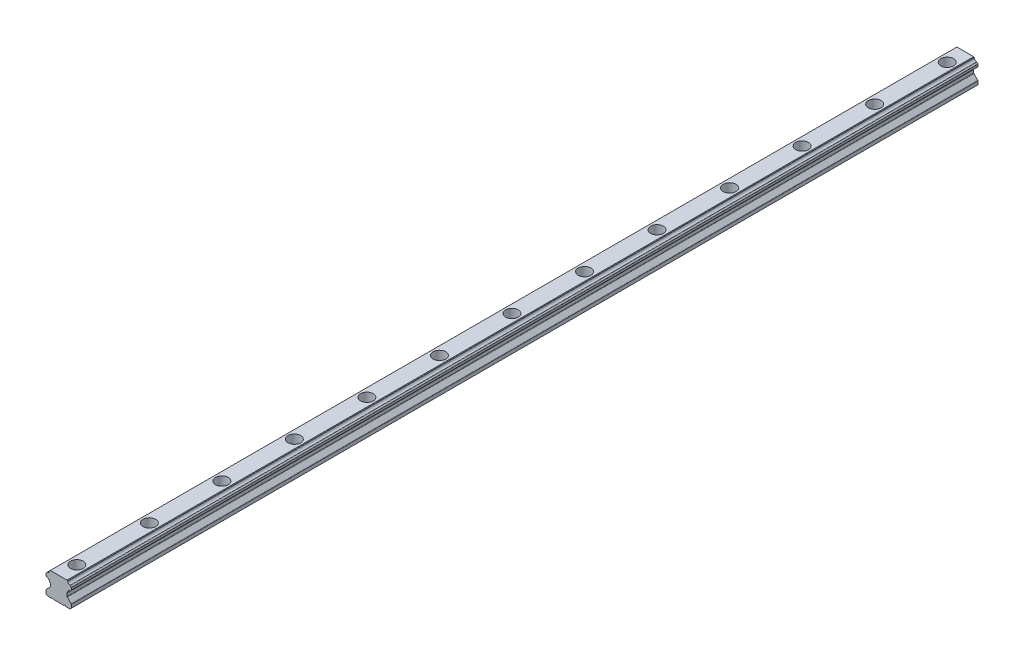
ISO-10303-21;
HEADER;
FILE_DESCRIPTION(('STEP AP214'),'2;1');
FILE_NAME('part.step','',(''),(''),'','','');
FILE_SCHEMA(('AUTOMOTIVE_DESIGN { 1 0 10303 214 1 1 1 1 }'));
ENDSEC;
DATA;
#1=APPLICATION_CONTEXT('core data for automotive mechanical design processes');
#2=APPLICATION_PROTOCOL_DEFINITION('international standard','automotive_design',2000,#1);
#3=PRODUCT_CONTEXT('',#1,'mechanical');
#4=PRODUCT('Part','Part','',(#3));
#5=PRODUCT_RELATED_PRODUCT_CATEGORY('part','',(#4));
#6=PRODUCT_DEFINITION_FORMATION('','',#4);
#7=PRODUCT_DEFINITION_CONTEXT('part definition',#1,'design');
#8=PRODUCT_DEFINITION('design','',#6,#7);
#9=PRODUCT_DEFINITION_SHAPE('','',#8);
#10=(LENGTH_UNIT() NAMED_UNIT(*) SI_UNIT(.MILLI.,.METRE.));
#11=(NAMED_UNIT(*) PLANE_ANGLE_UNIT() SI_UNIT($,.RADIAN.));
#12=(NAMED_UNIT(*) SI_UNIT($,.STERADIAN.) SOLID_ANGLE_UNIT());
#13=UNCERTAINTY_MEASURE_WITH_UNIT(LENGTH_MEASURE(1.E-05),#10,'distance_accuracy_value','');
#14=(GEOMETRIC_REPRESENTATION_CONTEXT(3) GLOBAL_UNCERTAINTY_ASSIGNED_CONTEXT((#13)) GLOBAL_UNIT_ASSIGNED_CONTEXT((#10,
#11,#12)) REPRESENTATION_CONTEXT('',''));
#15=CARTESIAN_POINT('',(0.,0.,0.));
#16=DIRECTION('',(0.,0.,1.));
#17=DIRECTION('',(1.,0.,0.));
#18=AXIS2_PLACEMENT_3D('',#15,#16,#17);
#19=CARTESIAN_POINT('',(12.8595525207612,1.69969856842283,1000.));
#20=DIRECTION('',(0.,0.,-1.));
#21=DIRECTION('',(-1.,0.,0.));
#22=AXIS2_PLACEMENT_3D('',#19,#20,#21);
#23=CYLINDRICAL_SURFACE('',#22,2.83000000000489);
#24=CARTESIAN_POINT('',(12.8595525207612,1.69969856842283,0.));
#25=DIRECTION('',(0.,0.,-1.));
#26=DIRECTION('',(1.,0.,0.));
#27=AXIS2_PLACEMENT_3D('',#24,#25,#26);
#28=CIRCLE('',#27,2.83000000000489);
#29=CARTESIAN_POINT('',(10.0516714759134,2.05283315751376,0.));
#30=VERTEX_POINT('',#29);
#31=CARTESIAN_POINT('',(12.5064179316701,4.50757961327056,0.));
#32=VERTEX_POINT('',#31);
#33=EDGE_CURVE('E398',#30,#32,#28,.T.);
#34=ORIENTED_EDGE('',*,*,#33,.T.);
#35=DIRECTION('',(0.,0.,-1.));
#36=VECTOR('',#35,1.);
#37=CARTESIAN_POINT('',(12.5064179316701,4.50757961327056,1000.));
#38=LINE('',#37,#36);
#39=CARTESIAN_POINT('',(12.5064179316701,4.50757961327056,1000.));
#40=VERTEX_POINT('',#39);
#41=EDGE_CURVE('E12',#40,#32,#38,.T.);
#42=ORIENTED_EDGE('',*,*,#41,.F.);
#43=CARTESIAN_POINT('',(12.8595525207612,1.69969856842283,1000.));
#44=DIRECTION('',(0.,0.,-1.));
#45=DIRECTION('',(1.,0.,0.));
#46=AXIS2_PLACEMENT_3D('',#43,#44,#45);
#47=CIRCLE('',#46,2.83000000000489);
#48=CARTESIAN_POINT('',(10.0516714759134,2.05283315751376,1000.));
#49=VERTEX_POINT('',#48);
#50=EDGE_CURVE('E547',#49,#40,#47,.T.);
#51=ORIENTED_EDGE('',*,*,#50,.F.);
#52=DIRECTION('',(0.,0.,-1.));
#53=VECTOR('',#52,1.);
#54=CARTESIAN_POINT('',(10.0516714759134,2.05283315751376,1000.));
#55=LINE('',#54,#53);
#56=EDGE_CURVE('E394',#49,#30,#55,.T.);
#57=ORIENTED_EDGE('',*,*,#56,.T.);
#58=EDGE_LOOP('',(#34,#42,#51,#57));
#59=FACE_BOUND('',#58,.T.);
#60=ADVANCED_FACE('F45',(#59),#23,.F.);
#61=CARTESIAN_POINT('',(12.4315484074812,5.10289008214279,1000.));
#62=DIRECTION('',(0.,0.,-1.));
#63=DIRECTION('',(-1.,0.,0.));
#64=AXIS2_PLACEMENT_3D('',#61,#62,#63);
#65=CYLINDRICAL_SURFACE('',#64,0.600000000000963);
#66=CARTESIAN_POINT('',(12.4315484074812,5.10289008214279,0.));
#67=DIRECTION('',(0.,0.,1.));
#68=DIRECTION('',(1.,0.,0.));
#69=AXIS2_PLACEMENT_3D('',#66,#67,#68);
#70=CIRCLE('',#69,0.600000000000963);
#71=CARTESIAN_POINT('',(12.8558124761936,4.67862601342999,0.));
#72=VERTEX_POINT('',#71);
#73=EDGE_CURVE('E402',#32,#72,#70,.T.);
#74=ORIENTED_EDGE('',*,*,#73,.T.);
#75=DIRECTION('',(0.,0.,-1.));
#76=VECTOR('',#75,1.);
#77=CARTESIAN_POINT('',(12.8558124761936,4.67862601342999,1000.));
#78=LINE('',#77,#76);
#79=CARTESIAN_POINT('',(12.8558124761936,4.67862601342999,1000.));
#80=VERTEX_POINT('',#79);
#81=EDGE_CURVE('E54',#80,#72,#78,.T.);
#82=ORIENTED_EDGE('',*,*,#81,.F.);
#83=CARTESIAN_POINT('',(12.4315484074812,5.10289008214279,1000.));
#84=DIRECTION('',(0.,0.,1.));
#85=DIRECTION('',(1.,0.,0.));
#86=AXIS2_PLACEMENT_3D('',#83,#84,#85);
#87=CIRCLE('',#86,0.600000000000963);
#88=EDGE_CURVE('E231',#40,#80,#87,.T.);
#89=ORIENTED_EDGE('',*,*,#88,.F.);
#90=ORIENTED_EDGE('',*,*,#41,.T.);
#91=EDGE_LOOP('',(#74,#82,#89,#90));
#92=FACE_BOUND('',#91,.T.);
#93=ADVANCED_FACE('F907',(#92),#65,.T.);
#94=CARTESIAN_POINT('',(12.8558124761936,4.67862601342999,1000.));
#95=DIRECTION('',(-0.707106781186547,0.707106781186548,0.));
#96=DIRECTION('',(-0.707106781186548,-0.707106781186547,0.));
#97=AXIS2_PLACEMENT_3D('',#94,#95,#96);
#98=PLANE('',#97);
#99=DIRECTION('',(0.707106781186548,0.707106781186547,0.));
#100=VECTOR('',#99,1.);
#101=CARTESIAN_POINT('',(12.8558124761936,4.67862601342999,0.));
#102=LINE('',#101,#100);
#103=CARTESIAN_POINT('',(13.9571015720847,5.77991510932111,0.));
#104=VERTEX_POINT('',#103);
#105=EDGE_CURVE('E406',#72,#104,#102,.T.);
#106=ORIENTED_EDGE('',*,*,#105,.T.);
#107=DIRECTION('',(0.,0.,-1.));
#108=VECTOR('',#107,1.);
#109=CARTESIAN_POINT('',(13.9571015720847,5.77991510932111,1000.));
#110=LINE('',#109,#108);
#111=CARTESIAN_POINT('',(13.9571015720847,5.77991510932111,1000.));
#112=VERTEX_POINT('',#111);
#113=EDGE_CURVE('E726',#112,#104,#110,.T.);
#114=ORIENTED_EDGE('',*,*,#113,.F.);
#115=DIRECTION('',(0.707106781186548,0.707106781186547,0.));
#116=VECTOR('',#115,1.);
#117=CARTESIAN_POINT('',(12.8558124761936,4.67862601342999,1000.));
#118=LINE('',#117,#116);
#119=EDGE_CURVE('E736',#80,#112,#118,.T.);
#120=ORIENTED_EDGE('',*,*,#119,.F.);
#121=ORIENTED_EDGE('',*,*,#81,.T.);
#122=EDGE_LOOP('',(#106,#114,#120,#121));
#123=FACE_BOUND('',#122,.T.);
#124=ADVANCED_FACE('F734',(#123),#98,.F.);
#125=CARTESIAN_POINT('',(13.532837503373,6.20417917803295,1000.));
#126=DIRECTION('',(0.,0.,-1.));
#127=DIRECTION('',(-1.,0.,0.));
#128=AXIS2_PLACEMENT_3D('',#125,#126,#127);
#129=CYLINDRICAL_SURFACE('',#128,0.599999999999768);
#130=CARTESIAN_POINT('',(13.532837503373,6.20417917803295,0.));
#131=DIRECTION('',(0.,0.,1.));
#132=DIRECTION('',(1.,0.,0.));
#133=AXIS2_PLACEMENT_3D('',#130,#131,#132);
#134=CIRCLE('',#133,0.599999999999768);
#135=CARTESIAN_POINT('',(14.1328375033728,6.20417917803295,0.));
#136=VERTEX_POINT('',#135);
#137=EDGE_CURVE('E409',#104,#136,#134,.T.);
#138=ORIENTED_EDGE('',*,*,#137,.T.);
#139=DIRECTION('',(0.,0.,-1.));
#140=VECTOR('',#139,1.);
#141=CARTESIAN_POINT('',(14.1328375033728,6.20417917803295,1000.));
#142=LINE('',#141,#140);
#143=CARTESIAN_POINT('',(14.1328375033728,6.20417917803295,1000.));
#144=VERTEX_POINT('',#143);
#145=EDGE_CURVE('E722',#144,#136,#142,.T.);
#146=ORIENTED_EDGE('',*,*,#145,.F.);
#147=CARTESIAN_POINT('',(13.532837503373,6.20417917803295,1000.));
#148=DIRECTION('',(0.,0.,1.));
#149=DIRECTION('',(1.,0.,0.));
#150=AXIS2_PLACEMENT_3D('',#147,#148,#149);
#151=CIRCLE('',#150,0.599999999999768);
#152=EDGE_CURVE('E755',#112,#144,#151,.T.);
#153=ORIENTED_EDGE('',*,*,#152,.F.);
#154=ORIENTED_EDGE('',*,*,#113,.T.);
#155=EDGE_LOOP('',(#138,#146,#153,#154));
#156=FACE_BOUND('',#155,.T.);
#157=ADVANCED_FACE('F745',(#156),#129,.T.);
#158=CARTESIAN_POINT('',(14.1328375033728,6.20417917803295,1000.));
#159=DIRECTION('',(-1.,0.,0.));
#160=DIRECTION('',(0.,0.,1.));
#161=AXIS2_PLACEMENT_3D('',#158,#159,#160);
#162=PLANE('',#161);
#163=DIRECTION('',(0.,1.,0.));
#164=VECTOR('',#163,1.);
#165=CARTESIAN_POINT('',(14.1328375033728,6.20417917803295,0.));
#166=LINE('',#165,#164);
#167=CARTESIAN_POINT('',(14.1328375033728,8.22463396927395,0.));
#168=VERTEX_POINT('',#167);
#169=EDGE_CURVE('E412',#136,#168,#166,.T.);
#170=ORIENTED_EDGE('',*,*,#169,.T.);
#171=DIRECTION('',(0.,0.,-1.));
#172=VECTOR('',#171,1.);
#173=CARTESIAN_POINT('',(14.1328375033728,8.22463396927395,1000.));
#174=LINE('',#173,#172);
#175=CARTESIAN_POINT('',(14.1328375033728,8.22463396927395,1000.));
#176=VERTEX_POINT('',#175);
#177=EDGE_CURVE('E718',#176,#168,#174,.T.);
#178=ORIENTED_EDGE('',*,*,#177,.F.);
#179=DIRECTION('',(0.,1.,0.));
#180=VECTOR('',#179,1.);
#181=CARTESIAN_POINT('',(14.1328375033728,6.20417917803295,1000.));
#182=LINE('',#181,#180);
#183=EDGE_CURVE('E751',#144,#176,#182,.T.);
#184=ORIENTED_EDGE('',*,*,#183,.F.);
#185=ORIENTED_EDGE('',*,*,#145,.T.);
#186=EDGE_LOOP('',(#170,#178,#184,#185));
#187=FACE_BOUND('',#186,.T.);
#188=ADVANCED_FACE('F749',(#187),#162,.F.);
#189=CARTESIAN_POINT('',(13.5328375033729,8.22463396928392,1000.));
#190=DIRECTION('',(0.,0.,-1.));
#191=DIRECTION('',(-1.,0.,0.));
#192=AXIS2_PLACEMENT_3D('',#189,#190,#191);
#193=CYLINDRICAL_SURFACE('',#192,0.599999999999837);
#194=CARTESIAN_POINT('',(13.5328375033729,8.22463396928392,0.));
#195=DIRECTION('',(0.,0.,1.));
#196=DIRECTION('',(1.,0.,0.));
#197=AXIS2_PLACEMENT_3D('',#194,#195,#196);
#198=CIRCLE('',#197,0.599999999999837);
#199=CARTESIAN_POINT('',(13.9571015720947,8.64889803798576,0.));
#200=VERTEX_POINT('',#199);
#201=EDGE_CURVE('E415',#168,#200,#198,.T.);
#202=ORIENTED_EDGE('',*,*,#201,.T.);
#203=DIRECTION('',(0.,0.,-1.));
#204=VECTOR('',#203,1.);
#205=CARTESIAN_POINT('',(13.9571015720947,8.64889803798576,1000.));
#206=LINE('',#205,#204);
#207=CARTESIAN_POINT('',(13.9571015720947,8.64889803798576,1000.));
#208=VERTEX_POINT('',#207);
#209=EDGE_CURVE('E714',#208,#200,#206,.T.);
#210=ORIENTED_EDGE('',*,*,#209,.F.);
#211=CARTESIAN_POINT('',(13.5328375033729,8.22463396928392,1000.));
#212=DIRECTION('',(0.,0.,1.));
#213=DIRECTION('',(1.,0.,0.));
#214=AXIS2_PLACEMENT_3D('',#211,#212,#213);
#215=CIRCLE('',#214,0.599999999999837);
#216=EDGE_CURVE('E754',#176,#208,#215,.T.);
#217=ORIENTED_EDGE('',*,*,#216,.F.);
#218=ORIENTED_EDGE('',*,*,#177,.T.);
#219=EDGE_LOOP('',(#202,#210,#217,#218));
#220=FACE_BOUND('',#219,.T.);
#221=ADVANCED_FACE('F920',(#220),#193,.T.);
#222=CARTESIAN_POINT('',(13.9571015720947,8.64889803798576,1000.));
#223=DIRECTION('',(-0.707106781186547,-0.707106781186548,0.));
#224=DIRECTION('',(0.707106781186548,-0.707106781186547,0.));
#225=AXIS2_PLACEMENT_3D('',#222,#223,#224);
#226=PLANE('',#225);
#227=DIRECTION('',(-0.707106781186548,0.707106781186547,0.));
#228=VECTOR('',#227,1.);
#229=CARTESIAN_POINT('',(13.9571015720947,8.64889803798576,0.));
#230=LINE('',#229,#228);
#231=CARTESIAN_POINT('',(12.8493940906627,9.75660551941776,0.));
#232=VERTEX_POINT('',#231);
#233=EDGE_CURVE('E418',#200,#232,#230,.T.);
#234=ORIENTED_EDGE('',*,*,#233,.T.);
#235=DIRECTION('',(0.,0.,-1.));
#236=VECTOR('',#235,1.);
#237=CARTESIAN_POINT('',(12.8493940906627,9.75660551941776,1000.));
#238=LINE('',#237,#236);
#239=CARTESIAN_POINT('',(12.8493940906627,9.75660551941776,1000.));
#240=VERTEX_POINT('',#239);
#241=EDGE_CURVE('E710',#240,#232,#238,.T.);
#242=ORIENTED_EDGE('',*,*,#241,.F.);
#243=DIRECTION('',(-0.707106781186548,0.707106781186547,0.));
#244=VECTOR('',#243,1.);
#245=CARTESIAN_POINT('',(13.9571015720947,8.64889803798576,1000.));
#246=LINE('',#245,#244);
#247=EDGE_CURVE('E759',#208,#240,#246,.T.);
#248=ORIENTED_EDGE('',*,*,#247,.F.);
#249=ORIENTED_EDGE('',*,*,#209,.T.);
#250=EDGE_LOOP('',(#234,#242,#248,#249));
#251=FACE_BOUND('',#250,.T.);
#252=ADVANCED_FACE('F923',(#251),#226,.F.);
#253=CARTESIAN_POINT('',(12.4251300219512,9.33234145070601,1000.));
#254=DIRECTION('',(0.,0.,-1.));
#255=DIRECTION('',(-1.,0.,0.));
#256=AXIS2_PLACEMENT_3D('',#253,#254,#255);
#257=CYLINDRICAL_SURFACE('',#256,0.599999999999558);
#258=CARTESIAN_POINT('',(12.4251300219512,9.33234145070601,0.));
#259=DIRECTION('',(0.,0.,1.));
#260=DIRECTION('',(1.,0.,0.));
#261=AXIS2_PLACEMENT_3D('',#258,#259,#260);
#262=CIRCLE('',#261,0.599999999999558);
#263=CARTESIAN_POINT('',(12.5011222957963,9.92750964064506,0.));
#264=VERTEX_POINT('',#263);
#265=EDGE_CURVE('E421',#232,#264,#262,.T.);
#266=ORIENTED_EDGE('',*,*,#265,.T.);
#267=DIRECTION('',(0.,0.,-1.));
#268=VECTOR('',#267,1.);
#269=CARTESIAN_POINT('',(12.5011222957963,9.92750964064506,1000.));
#270=LINE('',#269,#268);
#271=CARTESIAN_POINT('',(12.5011222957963,9.92750964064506,1000.));
#272=VERTEX_POINT('',#271);
#273=EDGE_CURVE('E706',#272,#264,#270,.T.);
#274=ORIENTED_EDGE('',*,*,#273,.F.);
#275=CARTESIAN_POINT('',(12.4251300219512,9.33234145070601,1000.));
#276=DIRECTION('',(0.,0.,1.));
#277=DIRECTION('',(1.,0.,0.));
#278=AXIS2_PLACEMENT_3D('',#275,#276,#277);
#279=CIRCLE('',#278,0.599999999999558);
#280=EDGE_CURVE('E766',#240,#272,#279,.T.);
#281=ORIENTED_EDGE('',*,*,#280,.F.);
#282=ORIENTED_EDGE('',*,*,#241,.T.);
#283=EDGE_LOOP('',(#266,#274,#281,#282));
#284=FACE_BOUND('',#283,.T.);
#285=ADVANCED_FACE('F927',(#284),#257,.T.);
#286=CARTESIAN_POINT('',(12.8595525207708,12.7347196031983,1000.));
#287=DIRECTION('',(0.,0.,-1.));
#288=DIRECTION('',(-1.,0.,0.));
#289=AXIS2_PLACEMENT_3D('',#286,#287,#288);
#290=CYLINDRICAL_SURFACE('',#289,2.83000000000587);
#291=CARTESIAN_POINT('',(12.8595525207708,12.7347196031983,0.));
#292=DIRECTION('',(0.,0.,-1.));
#293=DIRECTION('',(1.,0.,0.));
#294=AXIS2_PLACEMENT_3D('',#291,#292,#293);
#295=CIRCLE('',#294,2.83000000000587);
#296=CARTESIAN_POINT('',(10.0523425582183,12.3762893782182,0.));
#297=VERTEX_POINT('',#296);
#298=EDGE_CURVE('E424',#264,#297,#295,.T.);
#299=ORIENTED_EDGE('',*,*,#298,.T.);
#300=DIRECTION('',(0.,0.,-1.));
#301=VECTOR('',#300,1.);
#302=CARTESIAN_POINT('',(10.0523425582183,12.3762893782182,1000.));
#303=LINE('',#302,#301);
#304=CARTESIAN_POINT('',(10.0523425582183,12.3762893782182,1000.));
#305=VERTEX_POINT('',#304);
#306=EDGE_CURVE('E702',#305,#297,#303,.T.);
#307=ORIENTED_EDGE('',*,*,#306,.F.);
#308=CARTESIAN_POINT('',(12.8595525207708,12.7347196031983,1000.));
#309=DIRECTION('',(0.,0.,-1.));
#310=DIRECTION('',(1.,0.,0.));
#311=AXIS2_PLACEMENT_3D('',#308,#309,#310);
#312=CIRCLE('',#311,2.83000000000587);
#313=EDGE_CURVE('E769',#272,#305,#312,.T.);
#314=ORIENTED_EDGE('',*,*,#313,.F.);
#315=ORIENTED_EDGE('',*,*,#273,.T.);
#316=EDGE_LOOP('',(#299,#307,#314,#315));
#317=FACE_BOUND('',#316,.T.);
#318=ADVANCED_FACE('F931',(#317),#290,.F.);
#319=CARTESIAN_POINT('',(9.45717436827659,12.3002971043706,1000.));
#320=DIRECTION('',(0.,0.,-1.));
#321=DIRECTION('',(-1.,0.,0.));
#322=AXIS2_PLACEMENT_3D('',#319,#320,#321);
#323=CYLINDRICAL_SURFACE('',#322,0.600000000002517);
#324=CARTESIAN_POINT('',(9.45717436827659,12.3002971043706,0.));
#325=DIRECTION('',(0.,0.,1.));
#326=DIRECTION('',(1.,0.,0.));
#327=AXIS2_PLACEMENT_3D('',#324,#325,#326);
#328=CIRCLE('',#327,0.600000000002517);
#329=CARTESIAN_POINT('',(9.88143843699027,12.7245611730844,0.));
#330=VERTEX_POINT('',#329);
#331=EDGE_CURVE('E427',#297,#330,#328,.T.);
#332=ORIENTED_EDGE('',*,*,#331,.T.);
#333=DIRECTION('',(0.,0.,-1.));
#334=VECTOR('',#333,1.);
#335=CARTESIAN_POINT('',(9.88143843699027,12.7245611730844,1000.));
#336=LINE('',#335,#334);
#337=CARTESIAN_POINT('',(9.88143843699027,12.7245611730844,1000.));
#338=VERTEX_POINT('',#337);
#339=EDGE_CURVE('E698',#338,#330,#336,.T.);
#340=ORIENTED_EDGE('',*,*,#339,.F.);
#341=CARTESIAN_POINT('',(9.45717436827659,12.3002971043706,1000.));
#342=DIRECTION('',(0.,0.,1.));
#343=DIRECTION('',(1.,0.,0.));
#344=AXIS2_PLACEMENT_3D('',#341,#342,#343);
#345=CIRCLE('',#344,0.600000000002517);
#346=EDGE_CURVE('E772',#305,#338,#345,.T.);
#347=ORIENTED_EDGE('',*,*,#346,.F.);
#348=ORIENTED_EDGE('',*,*,#306,.T.);
#349=EDGE_LOOP('',(#332,#340,#347,#348));
#350=FACE_BOUND('',#349,.T.);
#351=ADVANCED_FACE('F935',(#350),#323,.T.);
#352=CARTESIAN_POINT('',(9.88143843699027,12.7245611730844,1000.));
#353=DIRECTION('',(-0.707106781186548,-0.707106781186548,0.));
#354=DIRECTION('',(0.707106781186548,-0.707106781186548,0.));
#355=AXIS2_PLACEMENT_3D('',#352,#353,#354);
#356=PLANE('',#355);
#357=DIRECTION('',(-0.707106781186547,0.707106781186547,0.));
#358=VECTOR('',#357,1.);
#359=CARTESIAN_POINT('',(9.88143843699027,12.7245611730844,0.));
#360=LINE('',#359,#358);
#361=CARTESIAN_POINT('',(9.38866802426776,13.2173315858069,0.));
#362=VERTEX_POINT('',#361);
#363=EDGE_CURVE('E430',#330,#362,#360,.T.);
#364=ORIENTED_EDGE('',*,*,#363,.T.);
#365=DIRECTION('',(0.,0.,-1.));
#366=VECTOR('',#365,1.);
#367=CARTESIAN_POINT('',(9.38866802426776,13.2173315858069,1000.));
#368=LINE('',#367,#366);
#369=CARTESIAN_POINT('',(9.38866802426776,13.2173315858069,1000.));
#370=VERTEX_POINT('',#369);
#371=EDGE_CURVE('E694',#370,#362,#368,.T.);
#372=ORIENTED_EDGE('',*,*,#371,.F.);
#373=DIRECTION('',(-0.707106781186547,0.707106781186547,0.));
#374=VECTOR('',#373,1.);
#375=CARTESIAN_POINT('',(9.88143843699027,12.7245611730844,1000.));
#376=LINE('',#375,#374);
#377=EDGE_CURVE('E775',#338,#370,#376,.T.);
#378=ORIENTED_EDGE('',*,*,#377,.F.);
#379=ORIENTED_EDGE('',*,*,#339,.T.);
#380=EDGE_LOOP('',(#364,#372,#378,#379));
#381=FACE_BOUND('',#380,.T.);
#382=ADVANCED_FACE('F939',(#381),#356,.F.);
#383=CARTESIAN_POINT('',(9.38866802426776,13.2173315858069,1000.));
#384=DIRECTION('',(0.,-1.,0.));
#385=DIRECTION('',(0.,0.,-1.));
#386=AXIS2_PLACEMENT_3D('',#383,#384,#385);
#387=PLANE('',#386);
#388=CARTESIAN_POINT('',(0.132837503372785,13.2173315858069,100.));
#389=DIRECTION('',(0.,1.,0.));
#390=DIRECTION('',(0.,0.,1.));
#391=AXIS2_PLACEMENT_3D('',#388,#389,#390);
#392=CIRCLE('',#391,7.);
#393=CARTESIAN_POINT('',(0.132837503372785,13.2173315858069,107.));
#394=VERTEX_POINT('',#393);
#395=EDGE_CURVE('E1970',#394,#394,#392,.T.);
#396=ORIENTED_EDGE('',*,*,#395,.F.);
#397=EDGE_LOOP('',(#396));
#398=FACE_BOUND('',#397,.T.);
#399=CARTESIAN_POINT('',(0.132837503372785,13.2173315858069,180.));
#400=DIRECTION('',(0.,1.,0.));
#401=DIRECTION('',(0.,0.,1.));
#402=AXIS2_PLACEMENT_3D('',#399,#400,#401);
#403=CIRCLE('',#402,7.);
#404=CARTESIAN_POINT('',(0.132837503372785,13.2173315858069,187.));
#405=VERTEX_POINT('',#404);
#406=EDGE_CURVE('E1984',#405,#405,#403,.T.);
#407=ORIENTED_EDGE('',*,*,#406,.F.);
#408=EDGE_LOOP('',(#407));
#409=FACE_BOUND('',#408,.T.);
#410=CARTESIAN_POINT('',(0.132837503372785,13.2173315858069,260.));
#411=DIRECTION('',(0.,1.,0.));
#412=DIRECTION('',(0.,0.,1.));
#413=AXIS2_PLACEMENT_3D('',#410,#411,#412);
#414=CIRCLE('',#413,7.);
#415=CARTESIAN_POINT('',(0.132837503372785,13.2173315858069,267.));
#416=VERTEX_POINT('',#415);
#417=EDGE_CURVE('E2000',#416,#416,#414,.T.);
#418=ORIENTED_EDGE('',*,*,#417,.F.);
#419=EDGE_LOOP('',(#418));
#420=FACE_BOUND('',#419,.T.);
#421=CARTESIAN_POINT('',(0.132837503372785,13.2173315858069,339.999999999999));
#422=DIRECTION('',(0.,1.,0.));
#423=DIRECTION('',(0.,0.,1.));
#424=AXIS2_PLACEMENT_3D('',#421,#422,#423);
#425=CIRCLE('',#424,7.);
#426=CARTESIAN_POINT('',(0.132837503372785,13.2173315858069,346.999999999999));
#427=VERTEX_POINT('',#426);
#428=EDGE_CURVE('E2016',#427,#427,#425,.T.);
#429=ORIENTED_EDGE('',*,*,#428,.F.);
#430=EDGE_LOOP('',(#429));
#431=FACE_BOUND('',#430,.T.);
#432=CARTESIAN_POINT('',(0.132837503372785,13.2173315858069,419.999999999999));
#433=DIRECTION('',(0.,1.,0.));
#434=DIRECTION('',(0.,0.,1.));
#435=AXIS2_PLACEMENT_3D('',#432,#433,#434);
#436=CIRCLE('',#435,7.);
#437=CARTESIAN_POINT('',(0.132837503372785,13.2173315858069,426.999999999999));
#438=VERTEX_POINT('',#437);
#439=EDGE_CURVE('E2032',#438,#438,#436,.T.);
#440=ORIENTED_EDGE('',*,*,#439,.F.);
#441=EDGE_LOOP('',(#440));
#442=FACE_BOUND('',#441,.T.);
#443=CARTESIAN_POINT('',(0.132837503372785,13.2173315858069,499.999999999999));
#444=DIRECTION('',(0.,1.,0.));
#445=DIRECTION('',(0.,0.,1.));
#446=AXIS2_PLACEMENT_3D('',#443,#444,#445);
#447=CIRCLE('',#446,7.);
#448=CARTESIAN_POINT('',(0.132837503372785,13.2173315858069,506.999999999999));
#449=VERTEX_POINT('',#448);
#450=EDGE_CURVE('E2048',#449,#449,#447,.T.);
#451=ORIENTED_EDGE('',*,*,#450,.F.);
#452=EDGE_LOOP('',(#451));
#453=FACE_BOUND('',#452,.T.);
#454=CARTESIAN_POINT('',(0.132837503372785,13.2173315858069,579.999999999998));
#455=DIRECTION('',(0.,1.,0.));
#456=DIRECTION('',(0.,0.,1.));
#457=AXIS2_PLACEMENT_3D('',#454,#455,#456);
#458=CIRCLE('',#457,7.);
#459=CARTESIAN_POINT('',(0.132837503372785,13.2173315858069,586.999999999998));
#460=VERTEX_POINT('',#459);
#461=EDGE_CURVE('E2064',#460,#460,#458,.T.);
#462=ORIENTED_EDGE('',*,*,#461,.F.);
#463=EDGE_LOOP('',(#462));
#464=FACE_BOUND('',#463,.T.);
#465=CARTESIAN_POINT('',(0.132837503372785,13.2173315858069,659.999999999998));
#466=DIRECTION('',(0.,1.,0.));
#467=DIRECTION('',(0.,0.,1.));
#468=AXIS2_PLACEMENT_3D('',#465,#466,#467);
#469=CIRCLE('',#468,7.);
#470=CARTESIAN_POINT('',(0.132837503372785,13.2173315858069,666.999999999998));
#471=VERTEX_POINT('',#470);
#472=EDGE_CURVE('E2080',#471,#471,#469,.T.);
#473=ORIENTED_EDGE('',*,*,#472,.F.);
#474=EDGE_LOOP('',(#473));
#475=FACE_BOUND('',#474,.T.);
#476=CARTESIAN_POINT('',(0.132837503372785,13.2173315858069,739.999999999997));
#477=DIRECTION('',(0.,1.,0.));
#478=DIRECTION('',(0.,0.,1.));
#479=AXIS2_PLACEMENT_3D('',#476,#477,#478);
#480=CIRCLE('',#479,7.);
#481=CARTESIAN_POINT('',(0.132837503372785,13.2173315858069,746.999999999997));
#482=VERTEX_POINT('',#481);
#483=EDGE_CURVE('E2096',#482,#482,#480,.T.);
#484=ORIENTED_EDGE('',*,*,#483,.F.);
#485=EDGE_LOOP('',(#484));
#486=FACE_BOUND('',#485,.T.);
#487=CARTESIAN_POINT('',(0.132837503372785,13.2173315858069,819.999999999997));
#488=DIRECTION('',(0.,1.,0.));
#489=DIRECTION('',(0.,0.,1.));
#490=AXIS2_PLACEMENT_3D('',#487,#488,#489);
#491=CIRCLE('',#490,7.);
#492=CARTESIAN_POINT('',(0.132837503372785,13.2173315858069,826.999999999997));
#493=VERTEX_POINT('',#492);
#494=EDGE_CURVE('E2112',#493,#493,#491,.T.);
#495=ORIENTED_EDGE('',*,*,#494,.F.);
#496=EDGE_LOOP('',(#495));
#497=FACE_BOUND('',#496,.T.);
#498=CARTESIAN_POINT('',(0.132837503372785,13.2173315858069,899.999999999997));
#499=DIRECTION('',(0.,1.,0.));
#500=DIRECTION('',(0.,0.,1.));
#501=AXIS2_PLACEMENT_3D('',#498,#499,#500);
#502=CIRCLE('',#501,7.);
#503=CARTESIAN_POINT('',(0.132837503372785,13.2173315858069,906.999999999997));
#504=VERTEX_POINT('',#503);
#505=EDGE_CURVE('E2128',#504,#504,#502,.T.);
#506=ORIENTED_EDGE('',*,*,#505,.F.);
#507=EDGE_LOOP('',(#506));
#508=FACE_BOUND('',#507,.T.);
#509=CARTESIAN_POINT('',(0.132837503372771,13.2173315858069,979.999999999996));
#510=DIRECTION('',(0.,1.,0.));
#511=DIRECTION('',(0.,0.,1.));
#512=AXIS2_PLACEMENT_3D('',#509,#510,#511);
#513=CIRCLE('',#512,7.);
#514=CARTESIAN_POINT('',(0.132837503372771,13.2173315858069,986.999999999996));
#515=VERTEX_POINT('',#514);
#516=EDGE_CURVE('E2144',#515,#515,#513,.T.);
#517=ORIENTED_EDGE('',*,*,#516,.F.);
#518=EDGE_LOOP('',(#517));
#519=FACE_BOUND('',#518,.T.);
#520=CARTESIAN_POINT('',(0.132837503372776,13.2173315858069,20.));
#521=DIRECTION('',(0.,1.,0.));
#522=DIRECTION('',(0.,0.,1.));
#523=AXIS2_PLACEMENT_3D('',#520,#521,#522);
#524=CIRCLE('',#523,7.);
#525=CARTESIAN_POINT('',(0.132837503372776,13.2173315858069,27.));
#526=VERTEX_POINT('',#525);
#527=EDGE_CURVE('E2160',#526,#526,#524,.T.);
#528=ORIENTED_EDGE('',*,*,#527,.F.);
#529=EDGE_LOOP('',(#528));
#530=FACE_BOUND('',#529,.T.);
#531=DIRECTION('',(-1.,0.,0.));
#532=VECTOR('',#531,1.);
#533=CARTESIAN_POINT('',(9.38866802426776,13.2173315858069,0.));
#534=LINE('',#533,#532);
#535=CARTESIAN_POINT('',(-9.12299301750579,13.2173315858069,0.));
#536=VERTEX_POINT('',#535);
#537=EDGE_CURVE('E433',#362,#536,#534,.T.);
#538=ORIENTED_EDGE('',*,*,#537,.T.);
#539=DIRECTION('',(0.,0.,-1.));
#540=VECTOR('',#539,1.);
#541=CARTESIAN_POINT('',(-9.12299301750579,13.2173315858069,1000.));
#542=LINE('',#541,#540);
#543=CARTESIAN_POINT('',(-9.12299301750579,13.2173315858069,1000.));
#544=VERTEX_POINT('',#543);
#545=EDGE_CURVE('E690',#544,#536,#542,.T.);
#546=ORIENTED_EDGE('',*,*,#545,.F.);
#547=DIRECTION('',(-1.,0.,0.));
#548=VECTOR('',#547,1.);
#549=CARTESIAN_POINT('',(9.38866802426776,13.2173315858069,1000.));
#550=LINE('',#549,#548);
#551=EDGE_CURVE('E778',#370,#544,#550,.T.);
#552=ORIENTED_EDGE('',*,*,#551,.F.);
#553=ORIENTED_EDGE('',*,*,#371,.T.);
#554=EDGE_LOOP('',(#538,#546,#552,#553));
#555=FACE_BOUND('',#554,.T.);
#556=ADVANCED_FACE('F943',(#398,#409,#420,#431,#442,#453,#464,#475,#486,#497,#508,#519,#530,
#555),#387,.F.);
#557=CARTESIAN_POINT('',(-9.12299301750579,13.2173315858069,1000.));
#558=DIRECTION('',(0.707106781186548,-0.707106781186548,0.));
#559=DIRECTION('',(0.707106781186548,0.707106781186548,0.));
#560=AXIS2_PLACEMENT_3D('',#557,#558,#559);
#561=PLANE('',#560);
#562=DIRECTION('',(-0.707106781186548,-0.707106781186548,0.));
#563=VECTOR('',#562,1.);
#564=CARTESIAN_POINT('',(-9.12299301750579,13.2173315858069,0.));
#565=LINE('',#564,#563);
#566=CARTESIAN_POINT('',(-9.61576343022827,12.7245611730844,0.));
#567=VERTEX_POINT('',#566);
#568=EDGE_CURVE('E436',#536,#567,#565,.T.);
#569=ORIENTED_EDGE('',*,*,#568,.T.);
#570=DIRECTION('',(0.,0.,-1.));
#571=VECTOR('',#570,1.);
#572=CARTESIAN_POINT('',(-9.61576343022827,12.7245611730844,1000.));
#573=LINE('',#572,#571);
#574=CARTESIAN_POINT('',(-9.61576343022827,12.7245611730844,1000.));
#575=VERTEX_POINT('',#574);
#576=EDGE_CURVE('E686',#575,#567,#573,.T.);
#577=ORIENTED_EDGE('',*,*,#576,.F.);
#578=DIRECTION('',(-0.707106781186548,-0.707106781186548,0.));
#579=VECTOR('',#578,1.);
#580=CARTESIAN_POINT('',(-9.12299301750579,13.2173315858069,1000.));
#581=LINE('',#580,#579);
#582=EDGE_CURVE('E781',#544,#575,#581,.T.);
#583=ORIENTED_EDGE('',*,*,#582,.F.);
#584=ORIENTED_EDGE('',*,*,#545,.T.);
#585=EDGE_LOOP('',(#569,#577,#583,#584));
#586=FACE_BOUND('',#585,.T.);
#587=ADVANCED_FACE('F947',(#586),#561,.F.);
#588=CARTESIAN_POINT('',(-9.19149936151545,12.300297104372,1000.));
#589=DIRECTION('',(0.,0.,-1.));
#590=DIRECTION('',(-1.,0.,0.));
#591=AXIS2_PLACEMENT_3D('',#588,#589,#590);
#592=CYLINDRICAL_SURFACE('',#591,0.600000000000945);
#593=CARTESIAN_POINT('',(-9.19149936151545,12.300297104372,0.));
#594=DIRECTION('',(0.,0.,1.));
#595=DIRECTION('',(1.,0.,0.));
#596=AXIS2_PLACEMENT_3D('',#593,#594,#595);
#597=CIRCLE('',#596,0.600000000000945);
#598=CARTESIAN_POINT('',(-9.78666755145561,12.3762893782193,0.));
#599=VERTEX_POINT('',#598);
#600=EDGE_CURVE('E439',#567,#599,#597,.T.);
#601=ORIENTED_EDGE('',*,*,#600,.T.);
#602=DIRECTION('',(0.,0.,-1.));
#603=VECTOR('',#602,1.);
#604=CARTESIAN_POINT('',(-9.78666755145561,12.3762893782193,1000.));
#605=LINE('',#604,#603);
#606=CARTESIAN_POINT('',(-9.78666755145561,12.3762893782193,1000.));
#607=VERTEX_POINT('',#606);
#608=EDGE_CURVE('E682',#607,#599,#605,.T.);
#609=ORIENTED_EDGE('',*,*,#608,.F.);
#610=CARTESIAN_POINT('',(-9.19149936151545,12.300297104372,1000.));
#611=DIRECTION('',(0.,0.,1.));
#612=DIRECTION('',(1.,0.,0.));
#613=AXIS2_PLACEMENT_3D('',#610,#611,#612);
#614=CIRCLE('',#613,0.600000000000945);
#615=EDGE_CURVE('E784',#575,#607,#614,.T.);
#616=ORIENTED_EDGE('',*,*,#615,.F.);
#617=ORIENTED_EDGE('',*,*,#576,.T.);
#618=EDGE_LOOP('',(#601,#609,#616,#617));
#619=FACE_BOUND('',#618,.T.);
#620=ADVANCED_FACE('F951',(#619),#592,.T.);
#621=CARTESIAN_POINT('',(-12.5938775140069,12.7347196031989,1000.));
#622=DIRECTION('',(0.,0.,-1.));
#623=DIRECTION('',(-1.,0.,0.));
#624=AXIS2_PLACEMENT_3D('',#621,#622,#623);
#625=CYLINDRICAL_SURFACE('',#624,2.83000000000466);
#626=CARTESIAN_POINT('',(-12.5938775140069,12.7347196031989,0.));
#627=DIRECTION('',(0.,0.,-1.));
#628=DIRECTION('',(1.,0.,0.));
#629=AXIS2_PLACEMENT_3D('',#626,#627,#628);
#630=CIRCLE('',#629,2.83000000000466);
#631=CARTESIAN_POINT('',(-12.2354472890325,9.92750964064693,0.));
#632=VERTEX_POINT('',#631);
#633=EDGE_CURVE('E442',#599,#632,#630,.T.);
#634=ORIENTED_EDGE('',*,*,#633,.T.);
#635=DIRECTION('',(0.,0.,-1.));
#636=VECTOR('',#635,1.);
#637=CARTESIAN_POINT('',(-12.2354472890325,9.92750964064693,1000.));
#638=LINE('',#637,#636);
#639=CARTESIAN_POINT('',(-12.2354472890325,9.92750964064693,1000.));
#640=VERTEX_POINT('',#639);
#641=EDGE_CURVE('E678',#640,#632,#638,.T.);
#642=ORIENTED_EDGE('',*,*,#641,.F.);
#643=CARTESIAN_POINT('',(-12.5938775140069,12.7347196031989,1000.));
#644=DIRECTION('',(0.,0.,-1.));
#645=DIRECTION('',(1.,0.,0.));
#646=AXIS2_PLACEMENT_3D('',#643,#644,#645);
#647=CIRCLE('',#646,2.83000000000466);
#648=EDGE_CURVE('E787',#607,#640,#647,.T.);
#649=ORIENTED_EDGE('',*,*,#648,.F.);
#650=ORIENTED_EDGE('',*,*,#608,.T.);
#651=EDGE_LOOP('',(#634,#642,#649,#650));
#652=FACE_BOUND('',#651,.T.);
#653=ADVANCED_FACE('F955',(#652),#625,.F.);
#654=CARTESIAN_POINT('',(-12.159455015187,9.33234145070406,1000.));
#655=DIRECTION('',(0.,0.,-1.));
#656=DIRECTION('',(-1.,0.,0.));
#657=AXIS2_PLACEMENT_3D('',#654,#655,#656);
#658=CYLINDRICAL_SURFACE('',#657,0.600000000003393);
#659=CARTESIAN_POINT('',(-12.159455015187,9.33234145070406,0.));
#660=DIRECTION('',(0.,0.,1.));
#661=DIRECTION('',(1.,0.,0.));
#662=AXIS2_PLACEMENT_3D('',#659,#660,#661);
#663=CIRCLE('',#662,0.600000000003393);
#664=CARTESIAN_POINT('',(-12.5837190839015,9.75660551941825,0.));
#665=VERTEX_POINT('',#664);
#666=EDGE_CURVE('E445',#632,#665,#663,.T.);
#667=ORIENTED_EDGE('',*,*,#666,.T.);
#668=DIRECTION('',(0.,0.,-1.));
#669=VECTOR('',#668,1.);
#670=CARTESIAN_POINT('',(-12.5837190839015,9.75660551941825,1000.));
#671=LINE('',#670,#669);
#672=CARTESIAN_POINT('',(-12.5837190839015,9.75660551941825,1000.));
#673=VERTEX_POINT('',#672);
#674=EDGE_CURVE('E674',#673,#665,#671,.T.);
#675=ORIENTED_EDGE('',*,*,#674,.F.);
#676=CARTESIAN_POINT('',(-12.159455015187,9.33234145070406,1000.));
#677=DIRECTION('',(0.,0.,1.));
#678=DIRECTION('',(1.,0.,0.));
#679=AXIS2_PLACEMENT_3D('',#676,#677,#678);
#680=CIRCLE('',#679,0.600000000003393);
#681=EDGE_CURVE('E790',#640,#673,#680,.T.);
#682=ORIENTED_EDGE('',*,*,#681,.F.);
#683=ORIENTED_EDGE('',*,*,#641,.T.);
#684=EDGE_LOOP('',(#667,#675,#682,#683));
#685=FACE_BOUND('',#684,.T.);
#686=ADVANCED_FACE('F959',(#685),#658,.T.);
#687=CARTESIAN_POINT('',(-12.5837190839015,9.75660551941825,1000.));
#688=DIRECTION('',(0.707106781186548,-0.707106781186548,0.));
#689=DIRECTION('',(0.707106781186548,0.707106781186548,0.));
#690=AXIS2_PLACEMENT_3D('',#687,#688,#689);
#691=PLANE('',#690);
#692=DIRECTION('',(-0.707106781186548,-0.707106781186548,0.));
#693=VECTOR('',#692,1.);
#694=CARTESIAN_POINT('',(-12.5837190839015,9.75660551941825,0.));
#695=LINE('',#694,#693);
#696=CARTESIAN_POINT('',(-13.6914265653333,8.64889803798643,0.));
#697=VERTEX_POINT('',#696);
#698=EDGE_CURVE('E448',#665,#697,#695,.T.);
#699=ORIENTED_EDGE('',*,*,#698,.T.);
#700=DIRECTION('',(0.,0.,-1.));
#701=VECTOR('',#700,1.);
#702=CARTESIAN_POINT('',(-13.6914265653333,8.64889803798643,1000.));
#703=LINE('',#702,#701);
#704=CARTESIAN_POINT('',(-13.6914265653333,8.64889803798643,1000.));
#705=VERTEX_POINT('',#704);
#706=EDGE_CURVE('E670',#705,#697,#703,.T.);
#707=ORIENTED_EDGE('',*,*,#706,.F.);
#708=DIRECTION('',(-0.707106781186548,-0.707106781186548,0.));
#709=VECTOR('',#708,1.);
#710=CARTESIAN_POINT('',(-12.5837190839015,9.75660551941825,1000.));
#711=LINE('',#710,#709);
#712=EDGE_CURVE('E793',#673,#705,#711,.T.);
#713=ORIENTED_EDGE('',*,*,#712,.F.);
#714=ORIENTED_EDGE('',*,*,#674,.T.);
#715=EDGE_LOOP('',(#699,#707,#713,#714));
#716=FACE_BOUND('',#715,.T.);
#717=ADVANCED_FACE('F963',(#716),#691,.F.);
#718=CARTESIAN_POINT('',(-13.2671624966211,8.22463396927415,1000.));
#719=DIRECTION('',(0.,0.,-1.));
#720=DIRECTION('',(-1.,0.,0.));
#721=AXIS2_PLACEMENT_3D('',#718,#719,#720);
#722=CYLINDRICAL_SURFACE('',#721,0.600000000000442);
#723=CARTESIAN_POINT('',(-13.2671624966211,8.22463396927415,0.));
#724=DIRECTION('',(0.,0.,1.));
#725=DIRECTION('',(1.,0.,0.));
#726=AXIS2_PLACEMENT_3D('',#723,#724,#725);
#727=CIRCLE('',#726,0.600000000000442);
#728=CARTESIAN_POINT('',(-13.8671624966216,8.22463396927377,0.));
#729=VERTEX_POINT('',#728);
#730=EDGE_CURVE('E451',#697,#729,#727,.T.);
#731=ORIENTED_EDGE('',*,*,#730,.T.);
#732=DIRECTION('',(0.,0.,-1.));
#733=VECTOR('',#732,1.);
#734=CARTESIAN_POINT('',(-13.8671624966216,8.22463396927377,1000.));
#735=LINE('',#734,#733);
#736=CARTESIAN_POINT('',(-13.8671624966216,8.22463396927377,1000.));
#737=VERTEX_POINT('',#736);
#738=EDGE_CURVE('E666',#737,#729,#735,.T.);
#739=ORIENTED_EDGE('',*,*,#738,.F.);
#740=CARTESIAN_POINT('',(-13.2671624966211,8.22463396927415,1000.));
#741=DIRECTION('',(0.,0.,1.));
#742=DIRECTION('',(1.,0.,0.));
#743=AXIS2_PLACEMENT_3D('',#740,#741,#742);
#744=CIRCLE('',#743,0.600000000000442);
#745=EDGE_CURVE('E796',#705,#737,#744,.T.);
#746=ORIENTED_EDGE('',*,*,#745,.F.);
#747=ORIENTED_EDGE('',*,*,#706,.T.);
#748=EDGE_LOOP('',(#731,#739,#746,#747));
#749=FACE_BOUND('',#748,.T.);
#750=ADVANCED_FACE('F967',(#749),#722,.T.);
#751=CARTESIAN_POINT('',(-13.8671624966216,8.22463396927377,1000.));
#752=DIRECTION('',(1.,0.,0.));
#753=DIRECTION('',(0.,0.,-1.));
#754=AXIS2_PLACEMENT_3D('',#751,#752,#753);
#755=PLANE('',#754);
#756=DIRECTION('',(0.,-1.,0.));
#757=VECTOR('',#756,1.);
#758=CARTESIAN_POINT('',(-13.8671624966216,8.22463396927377,0.));
#759=LINE('',#758,#757);
#760=CARTESIAN_POINT('',(-13.8671624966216,6.20417917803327,0.));
#761=VERTEX_POINT('',#760);
#762=EDGE_CURVE('E454',#729,#761,#759,.T.);
#763=ORIENTED_EDGE('',*,*,#762,.T.);
#764=DIRECTION('',(0.,0.,-1.));
#765=VECTOR('',#764,1.);
#766=CARTESIAN_POINT('',(-13.8671624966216,6.20417917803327,1000.));
#767=LINE('',#766,#765);
#768=CARTESIAN_POINT('',(-13.8671624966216,6.20417917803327,1000.));
#769=VERTEX_POINT('',#768);
#770=EDGE_CURVE('E662',#769,#761,#767,.T.);
#771=ORIENTED_EDGE('',*,*,#770,.F.);
#772=DIRECTION('',(0.,-1.,0.));
#773=VECTOR('',#772,1.);
#774=CARTESIAN_POINT('',(-13.8671624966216,8.22463396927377,1000.));
#775=LINE('',#774,#773);
#776=EDGE_CURVE('E799',#737,#769,#775,.T.);
#777=ORIENTED_EDGE('',*,*,#776,.F.);
#778=ORIENTED_EDGE('',*,*,#738,.T.);
#779=EDGE_LOOP('',(#763,#771,#777,#778));
#780=FACE_BOUND('',#779,.T.);
#781=ADVANCED_FACE('F971',(#780),#755,.F.);
#782=CARTESIAN_POINT('',(-13.2671624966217,6.20417917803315,1000.));
#783=DIRECTION('',(0.,0.,-1.));
#784=DIRECTION('',(-1.,0.,0.));
#785=AXIS2_PLACEMENT_3D('',#782,#783,#784);
#786=CYLINDRICAL_SURFACE('',#785,0.599999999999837);
#787=CARTESIAN_POINT('',(-13.2671624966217,6.20417917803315,0.));
#788=DIRECTION('',(0.,0.,1.));
#789=DIRECTION('',(1.,0.,0.));
#790=AXIS2_PLACEMENT_3D('',#787,#788,#789);
#791=CIRCLE('',#790,0.599999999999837);
#792=CARTESIAN_POINT('',(-13.6914265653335,5.77991510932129,0.));
#793=VERTEX_POINT('',#792);
#794=EDGE_CURVE('E457',#761,#793,#791,.T.);
#795=ORIENTED_EDGE('',*,*,#794,.T.);
#796=DIRECTION('',(0.,0.,-1.));
#797=VECTOR('',#796,1.);
#798=CARTESIAN_POINT('',(-13.6914265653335,5.77991510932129,1000.));
#799=LINE('',#798,#797);
#800=CARTESIAN_POINT('',(-13.6914265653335,5.77991510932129,1000.));
#801=VERTEX_POINT('',#800);
#802=EDGE_CURVE('E658',#801,#793,#799,.T.);
#803=ORIENTED_EDGE('',*,*,#802,.F.);
#804=CARTESIAN_POINT('',(-13.2671624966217,6.20417917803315,1000.));
#805=DIRECTION('',(0.,0.,1.));
#806=DIRECTION('',(1.,0.,0.));
#807=AXIS2_PLACEMENT_3D('',#804,#805,#806);
#808=CIRCLE('',#807,0.599999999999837);
#809=EDGE_CURVE('E802',#769,#801,#808,.T.);
#810=ORIENTED_EDGE('',*,*,#809,.F.);
#811=ORIENTED_EDGE('',*,*,#770,.T.);
#812=EDGE_LOOP('',(#795,#803,#810,#811));
#813=FACE_BOUND('',#812,.T.);
#814=ADVANCED_FACE('F975',(#813),#786,.T.);
#815=CARTESIAN_POINT('',(-13.6914265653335,5.77991510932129,1000.));
#816=DIRECTION('',(0.707106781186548,0.707106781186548,0.));
#817=DIRECTION('',(-0.707106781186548,0.707106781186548,0.));
#818=AXIS2_PLACEMENT_3D('',#815,#816,#817);
#819=PLANE('',#818);
#820=DIRECTION('',(0.707106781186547,-0.707106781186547,0.));
#821=VECTOR('',#820,1.);
#822=CARTESIAN_POINT('',(-13.6914265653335,5.77991510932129,0.));
#823=LINE('',#822,#821);
#824=CARTESIAN_POINT('',(-12.5901374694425,4.67862601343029,0.));
#825=VERTEX_POINT('',#824);
#826=EDGE_CURVE('E460',#793,#825,#823,.T.);
#827=ORIENTED_EDGE('',*,*,#826,.T.);
#828=DIRECTION('',(0.,0.,-1.));
#829=VECTOR('',#828,1.);
#830=CARTESIAN_POINT('',(-12.5901374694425,4.67862601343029,1000.));
#831=LINE('',#830,#829);
#832=CARTESIAN_POINT('',(-12.5901374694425,4.67862601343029,1000.));
#833=VERTEX_POINT('',#832);
#834=EDGE_CURVE('E654',#833,#825,#831,.T.);
#835=ORIENTED_EDGE('',*,*,#834,.F.);
#836=DIRECTION('',(0.707106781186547,-0.707106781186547,0.));
#837=VECTOR('',#836,1.);
#838=CARTESIAN_POINT('',(-13.6914265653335,5.77991510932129,1000.));
#839=LINE('',#838,#837);
#840=EDGE_CURVE('E805',#801,#833,#839,.T.);
#841=ORIENTED_EDGE('',*,*,#840,.F.);
#842=ORIENTED_EDGE('',*,*,#802,.T.);
#843=EDGE_LOOP('',(#827,#835,#841,#842));
#844=FACE_BOUND('',#843,.T.);
#845=ADVANCED_FACE('F979',(#844),#819,.F.);
#846=CARTESIAN_POINT('',(-12.1658734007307,5.10289008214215,1000.));
#847=DIRECTION('',(0.,0.,-1.));
#848=DIRECTION('',(-1.,0.,0.));
#849=AXIS2_PLACEMENT_3D('',#846,#847,#848);
#850=CYLINDRICAL_SURFACE('',#849,0.599999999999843);
#851=CARTESIAN_POINT('',(-12.1658734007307,5.10289008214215,0.));
#852=DIRECTION('',(0.,0.,1.));
#853=DIRECTION('',(1.,0.,0.));
#854=AXIS2_PLACEMENT_3D('',#851,#852,#853);
#855=CIRCLE('',#854,0.599999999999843);
#856=CARTESIAN_POINT('',(-12.2407429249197,4.50757961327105,0.));
#857=VERTEX_POINT('',#856);
#858=EDGE_CURVE('E463',#825,#857,#855,.T.);
#859=ORIENTED_EDGE('',*,*,#858,.T.);
#860=DIRECTION('',(0.,0.,-1.));
#861=VECTOR('',#860,1.);
#862=CARTESIAN_POINT('',(-12.2407429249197,4.50757961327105,1000.));
#863=LINE('',#862,#861);
#864=CARTESIAN_POINT('',(-12.2407429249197,4.50757961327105,1000.));
#865=VERTEX_POINT('',#864);
#866=EDGE_CURVE('E650',#865,#857,#863,.T.);
#867=ORIENTED_EDGE('',*,*,#866,.F.);
#868=CARTESIAN_POINT('',(-12.1658734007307,5.10289008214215,1000.));
#869=DIRECTION('',(0.,0.,1.));
#870=DIRECTION('',(1.,0.,0.));
#871=AXIS2_PLACEMENT_3D('',#868,#869,#870);
#872=CIRCLE('',#871,0.599999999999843);
#873=EDGE_CURVE('E808',#833,#865,#872,.T.);
#874=ORIENTED_EDGE('',*,*,#873,.F.);
#875=ORIENTED_EDGE('',*,*,#834,.T.);
#876=EDGE_LOOP('',(#859,#867,#874,#875));
#877=FACE_BOUND('',#876,.T.);
#878=ADVANCED_FACE('F983',(#877),#850,.T.);
#879=CARTESIAN_POINT('',(-12.5938775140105,1.69969856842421,1000.));
#880=DIRECTION('',(0.,0.,-1.));
#881=DIRECTION('',(-1.,0.,0.));
#882=AXIS2_PLACEMENT_3D('',#879,#880,#881);
#883=CYLINDRICAL_SURFACE('',#882,2.83000000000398);
#884=CARTESIAN_POINT('',(-12.5938775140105,1.69969856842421,0.));
#885=DIRECTION('',(0.,0.,-1.));
#886=DIRECTION('',(1.,0.,0.));
#887=AXIS2_PLACEMENT_3D('',#884,#885,#886);
#888=CIRCLE('',#887,2.83000000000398);
#889=CARTESIAN_POINT('',(-9.78599646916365,2.05283315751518,0.));
#890=VERTEX_POINT('',#889);
#891=EDGE_CURVE('E466',#857,#890,#888,.T.);
#892=ORIENTED_EDGE('',*,*,#891,.T.);
#893=DIRECTION('',(0.,0.,-1.));
#894=VECTOR('',#893,1.);
#895=CARTESIAN_POINT('',(-9.78599646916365,2.05283315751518,1000.));
#896=LINE('',#895,#894);
#897=CARTESIAN_POINT('',(-9.78599646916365,2.05283315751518,1000.));
#898=VERTEX_POINT('',#897);
#899=EDGE_CURVE('E646',#898,#890,#896,.T.);
#900=ORIENTED_EDGE('',*,*,#899,.F.);
#901=CARTESIAN_POINT('',(-12.5938775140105,1.69969856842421,1000.));
#902=DIRECTION('',(0.,0.,-1.));
#903=DIRECTION('',(1.,0.,0.));
#904=AXIS2_PLACEMENT_3D('',#901,#902,#903);
#905=CIRCLE('',#904,2.83000000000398);
#906=EDGE_CURVE('E811',#865,#898,#905,.T.);
#907=ORIENTED_EDGE('',*,*,#906,.F.);
#908=ORIENTED_EDGE('',*,*,#866,.T.);
#909=EDGE_LOOP('',(#892,#900,#907,#908));
#910=FACE_BOUND('',#909,.T.);
#911=ADVANCED_FACE('F987',(#910),#883,.F.);
#912=CARTESIAN_POINT('',(-9.19068600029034,2.12770268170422,1000.));
#913=DIRECTION('',(0.,0.,-1.));
#914=DIRECTION('',(-1.,0.,0.));
#915=AXIS2_PLACEMENT_3D('',#912,#913,#914);
#916=CYLINDRICAL_SURFACE('',#915,0.600000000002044);
#917=CARTESIAN_POINT('',(-9.19068600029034,2.12770268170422,0.));
#918=DIRECTION('',(0.,0.,1.));
#919=DIRECTION('',(1.,0.,0.));
#920=AXIS2_PLACEMENT_3D('',#917,#918,#919);
#921=CIRCLE('',#920,0.600000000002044);
#922=CARTESIAN_POINT('',(-9.61495006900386,1.70343861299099,0.));
#923=VERTEX_POINT('',#922);
#924=EDGE_CURVE('E469',#890,#923,#921,.T.);
#925=ORIENTED_EDGE('',*,*,#924,.T.);
#926=DIRECTION('',(0.,0.,-1.));
#927=VECTOR('',#926,1.);
#928=CARTESIAN_POINT('',(-9.61495006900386,1.70343861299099,1000.));
#929=LINE('',#928,#927);
#930=CARTESIAN_POINT('',(-9.61495006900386,1.70343861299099,1000.));
#931=VERTEX_POINT('',#930);
#932=EDGE_CURVE('E642',#931,#923,#929,.T.);
#933=ORIENTED_EDGE('',*,*,#932,.F.);
#934=CARTESIAN_POINT('',(-9.19068600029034,2.12770268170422,1000.));
#935=DIRECTION('',(0.,0.,1.));
#936=DIRECTION('',(1.,0.,0.));
#937=AXIS2_PLACEMENT_3D('',#934,#935,#936);
#938=CIRCLE('',#937,0.600000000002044);
#939=EDGE_CURVE('E814',#898,#931,#938,.T.);
#940=ORIENTED_EDGE('',*,*,#939,.F.);
#941=ORIENTED_EDGE('',*,*,#899,.T.);
#942=EDGE_LOOP('',(#925,#933,#940,#941));
#943=FACE_BOUND('',#942,.T.);
#944=ADVANCED_FACE('F991',(#943),#916,.T.);
#945=CARTESIAN_POINT('',(-9.61495006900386,1.70343861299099,1000.));
#946=DIRECTION('',(0.707106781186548,0.707106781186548,0.));
#947=DIRECTION('',(-0.707106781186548,0.707106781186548,0.));
#948=AXIS2_PLACEMENT_3D('',#945,#946,#947);
#949=PLANE('',#948);
#950=DIRECTION('',(0.707106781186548,-0.707106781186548,0.));
#951=VECTOR('',#950,1.);
#952=CARTESIAN_POINT('',(-9.61495006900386,1.70343861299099,0.));
#953=LINE('',#952,#951);
#954=CARTESIAN_POINT('',(-9.40147707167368,1.48996561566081,0.));
#955=VERTEX_POINT('',#954);
#956=EDGE_CURVE('E472',#923,#955,#953,.T.);
#957=ORIENTED_EDGE('',*,*,#956,.T.);
#958=DIRECTION('',(0.,0.,-1.));
#959=VECTOR('',#958,1.);
#960=CARTESIAN_POINT('',(-9.40147707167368,1.48996561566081,1000.));
#961=LINE('',#960,#959);
#962=CARTESIAN_POINT('',(-9.40147707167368,1.48996561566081,1000.));
#963=VERTEX_POINT('',#962);
#964=EDGE_CURVE('E638',#963,#955,#961,.T.);
#965=ORIENTED_EDGE('',*,*,#964,.F.);
#966=DIRECTION('',(0.707106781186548,-0.707106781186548,0.));
#967=VECTOR('',#966,1.);
#968=CARTESIAN_POINT('',(-9.61495006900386,1.70343861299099,1000.));
#969=LINE('',#968,#967);
#970=EDGE_CURVE('E817',#931,#963,#969,.T.);
#971=ORIENTED_EDGE('',*,*,#970,.F.);
#972=ORIENTED_EDGE('',*,*,#932,.T.);
#973=EDGE_LOOP('',(#957,#965,#971,#972));
#974=FACE_BOUND('',#973,.T.);
#975=ADVANCED_FACE('F995',(#974),#949,.F.);
#976=CARTESIAN_POINT('',(-9.96716249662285,0.924280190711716,1000.));
#977=DIRECTION('',(0.,0.,-1.));
#978=DIRECTION('',(-1.,0.,0.));
#979=AXIS2_PLACEMENT_3D('',#976,#977,#978);
#980=CYLINDRICAL_SURFACE('',#979,0.799999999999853);
#981=CARTESIAN_POINT('',(-9.96716249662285,0.924280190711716,0.));
#982=DIRECTION('',(0.,0.,-1.));
#983=DIRECTION('',(1.,0.,0.));
#984=AXIS2_PLACEMENT_3D('',#981,#982,#983);
#985=CIRCLE('',#984,0.799999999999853);
#986=CARTESIAN_POINT('',(-9.167162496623,0.924280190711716,0.));
#987=VERTEX_POINT('',#986);
#988=EDGE_CURVE('E475',#955,#987,#985,.T.);
#989=ORIENTED_EDGE('',*,*,#988,.T.);
#990=DIRECTION('',(0.,0.,-1.));
#991=VECTOR('',#990,1.);
#992=CARTESIAN_POINT('',(-9.167162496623,0.924280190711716,1000.));
#993=LINE('',#992,#991);
#994=CARTESIAN_POINT('',(-9.167162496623,0.924280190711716,1000.));
#995=VERTEX_POINT('',#994);
#996=EDGE_CURVE('E634',#995,#987,#993,.T.);
#997=ORIENTED_EDGE('',*,*,#996,.F.);
#998=CARTESIAN_POINT('',(-9.96716249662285,0.924280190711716,1000.));
#999=DIRECTION('',(0.,0.,-1.));
#1000=DIRECTION('',(1.,0.,0.));
#1001=AXIS2_PLACEMENT_3D('',#998,#999,#1000);
#1002=CIRCLE('',#1001,0.799999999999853);
#1003=EDGE_CURVE('E820',#963,#995,#1002,.T.);
#1004=ORIENTED_EDGE('',*,*,#1003,.F.);
#1005=ORIENTED_EDGE('',*,*,#964,.T.);
#1006=EDGE_LOOP('',(#989,#997,#1004,#1005));
#1007=FACE_BOUND('',#1006,.T.);
#1008=ADVANCED_FACE('F999',(#1007),#980,.F.);
#1009=CARTESIAN_POINT('',(-9.167162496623,0.924280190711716,1000.));
#1010=DIRECTION('',(1.,0.,0.));
#1011=DIRECTION('',(0.,0.,-1.));
#1012=AXIS2_PLACEMENT_3D('',#1009,#1010,#1011);
#1013=PLANE('',#1012);
#1014=DIRECTION('',(0.,-1.,0.));
#1015=VECTOR('',#1014,1.);
#1016=CARTESIAN_POINT('',(-9.167162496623,0.924280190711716,0.));
#1017=LINE('',#1016,#1015);
#1018=CARTESIAN_POINT('',(-9.167162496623,-2.31019790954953,0.));
#1019=VERTEX_POINT('',#1018);
#1020=EDGE_CURVE('E478',#987,#1019,#1017,.T.);
#1021=ORIENTED_EDGE('',*,*,#1020,.T.);
#1022=DIRECTION('',(0.,0.,-1.));
#1023=VECTOR('',#1022,1.);
#1024=CARTESIAN_POINT('',(-9.167162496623,-2.31019790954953,1000.));
#1025=LINE('',#1024,#1023);
#1026=CARTESIAN_POINT('',(-9.167162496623,-2.31019790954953,1000.));
#1027=VERTEX_POINT('',#1026);
#1028=EDGE_CURVE('E630',#1027,#1019,#1025,.T.);
#1029=ORIENTED_EDGE('',*,*,#1028,.F.);
#1030=DIRECTION('',(0.,-1.,0.));
#1031=VECTOR('',#1030,1.);
#1032=CARTESIAN_POINT('',(-9.167162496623,0.924280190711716,1000.));
#1033=LINE('',#1032,#1031);
#1034=EDGE_CURVE('E823',#995,#1027,#1033,.T.);
#1035=ORIENTED_EDGE('',*,*,#1034,.F.);
#1036=ORIENTED_EDGE('',*,*,#996,.T.);
#1037=EDGE_LOOP('',(#1021,#1029,#1035,#1036));
#1038=FACE_BOUND('',#1037,.T.);
#1039=ADVANCED_FACE('F1003',(#1038),#1013,.F.);
#1040=CARTESIAN_POINT('',(-9.96716249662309,-2.31019790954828,1000.));
#1041=DIRECTION('',(0.,0.,-1.));
#1042=DIRECTION('',(-1.,0.,0.));
#1043=AXIS2_PLACEMENT_3D('',#1040,#1041,#1042);
#1044=CYLINDRICAL_SURFACE('',#1043,0.800000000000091);
#1045=CARTESIAN_POINT('',(-9.96716249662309,-2.31019790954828,0.));
#1046=DIRECTION('',(0.,0.,-1.));
#1047=DIRECTION('',(1.,0.,0.));
#1048=AXIS2_PLACEMENT_3D('',#1045,#1046,#1047);
#1049=CIRCLE('',#1048,0.800000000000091);
#1050=CARTESIAN_POINT('',(-9.40147707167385,-2.87588333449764,0.));
#1051=VERTEX_POINT('',#1050);
#1052=EDGE_CURVE('E481',#1019,#1051,#1049,.T.);
#1053=ORIENTED_EDGE('',*,*,#1052,.T.);
#1054=DIRECTION('',(0.,0.,-1.));
#1055=VECTOR('',#1054,1.);
#1056=CARTESIAN_POINT('',(-9.40147707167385,-2.87588333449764,1000.));
#1057=LINE('',#1056,#1055);
#1058=CARTESIAN_POINT('',(-9.40147707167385,-2.87588333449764,1000.));
#1059=VERTEX_POINT('',#1058);
#1060=EDGE_CURVE('E626',#1059,#1051,#1057,.T.);
#1061=ORIENTED_EDGE('',*,*,#1060,.F.);
#1062=CARTESIAN_POINT('',(-9.96716249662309,-2.31019790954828,1000.));
#1063=DIRECTION('',(0.,0.,-1.));
#1064=DIRECTION('',(1.,0.,0.));
#1065=AXIS2_PLACEMENT_3D('',#1062,#1063,#1064);
#1066=CIRCLE('',#1065,0.800000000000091);
#1067=EDGE_CURVE('E826',#1027,#1059,#1066,.T.);
#1068=ORIENTED_EDGE('',*,*,#1067,.F.);
#1069=ORIENTED_EDGE('',*,*,#1028,.T.);
#1070=EDGE_LOOP('',(#1053,#1061,#1068,#1069));
#1071=FACE_BOUND('',#1070,.T.);
#1072=ADVANCED_FACE('F1007',(#1071),#1044,.F.);
#1073=CARTESIAN_POINT('',(-9.40147707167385,-2.87588333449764,1000.));
#1074=DIRECTION('',(0.707106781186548,-0.707106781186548,0.));
#1075=DIRECTION('',(0.707106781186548,0.707106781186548,0.));
#1076=AXIS2_PLACEMENT_3D('',#1073,#1074,#1075);
#1077=PLANE('',#1076);
#1078=DIRECTION('',(-0.707106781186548,-0.707106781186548,0.));
#1079=VECTOR('',#1078,1.);
#1080=CARTESIAN_POINT('',(-9.40147707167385,-2.87588333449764,0.));
#1081=LINE('',#1080,#1079);
#1082=CARTESIAN_POINT('',(-13.6328479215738,-7.10725418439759,0.));
#1083=VERTEX_POINT('',#1082);
#1084=EDGE_CURVE('E484',#1051,#1083,#1081,.T.);
#1085=ORIENTED_EDGE('',*,*,#1084,.T.);
#1086=DIRECTION('',(0.,0.,-1.));
#1087=VECTOR('',#1086,1.);
#1088=CARTESIAN_POINT('',(-13.6328479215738,-7.10725418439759,1000.));
#1089=LINE('',#1088,#1087);
#1090=CARTESIAN_POINT('',(-13.6328479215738,-7.10725418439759,1000.));
#1091=VERTEX_POINT('',#1090);
#1092=EDGE_CURVE('E622',#1091,#1083,#1089,.T.);
#1093=ORIENTED_EDGE('',*,*,#1092,.F.);
#1094=DIRECTION('',(-0.707106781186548,-0.707106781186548,0.));
#1095=VECTOR('',#1094,1.);
#1096=CARTESIAN_POINT('',(-9.40147707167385,-2.87588333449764,1000.));
#1097=LINE('',#1096,#1095);
#1098=EDGE_CURVE('E829',#1059,#1091,#1097,.T.);
#1099=ORIENTED_EDGE('',*,*,#1098,.F.);
#1100=ORIENTED_EDGE('',*,*,#1060,.T.);
#1101=EDGE_LOOP('',(#1085,#1093,#1099,#1100));
#1102=FACE_BOUND('',#1101,.T.);
#1103=ADVANCED_FACE('F1011',(#1102),#1077,.F.);
#1104=CARTESIAN_POINT('',(-13.0671624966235,-7.67293960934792,1000.));
#1105=DIRECTION('',(0.,0.,-1.));
#1106=DIRECTION('',(-1.,0.,0.));
#1107=AXIS2_PLACEMENT_3D('',#1104,#1105,#1106);
#1108=CYLINDRICAL_SURFACE('',#1107,0.800000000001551);
#1109=CARTESIAN_POINT('',(-13.0671624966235,-7.67293960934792,0.));
#1110=DIRECTION('',(0.,0.,1.));
#1111=DIRECTION('',(1.,0.,0.));
#1112=AXIS2_PLACEMENT_3D('',#1109,#1110,#1111);
#1113=CIRCLE('',#1112,0.800000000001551);
#1114=CARTESIAN_POINT('',(-13.867162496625,-7.67293960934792,0.));
#1115=VERTEX_POINT('',#1114);
#1116=EDGE_CURVE('E487',#1083,#1115,#1113,.T.);
#1117=ORIENTED_EDGE('',*,*,#1116,.T.);
#1118=DIRECTION('',(0.,0.,-1.));
#1119=VECTOR('',#1118,1.);
#1120=CARTESIAN_POINT('',(-13.867162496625,-7.67293960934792,1000.));
#1121=LINE('',#1120,#1119);
#1122=CARTESIAN_POINT('',(-13.867162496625,-7.67293960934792,1000.));
#1123=VERTEX_POINT('',#1122);
#1124=EDGE_CURVE('E618',#1123,#1115,#1121,.T.);
#1125=ORIENTED_EDGE('',*,*,#1124,.F.);
#1126=CARTESIAN_POINT('',(-13.0671624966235,-7.67293960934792,1000.));
#1127=DIRECTION('',(0.,0.,1.));
#1128=DIRECTION('',(1.,0.,0.));
#1129=AXIS2_PLACEMENT_3D('',#1126,#1127,#1128);
#1130=CIRCLE('',#1129,0.800000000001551);
#1131=EDGE_CURVE('E832',#1091,#1123,#1130,.T.);
#1132=ORIENTED_EDGE('',*,*,#1131,.F.);
#1133=ORIENTED_EDGE('',*,*,#1092,.T.);
#1134=EDGE_LOOP('',(#1117,#1125,#1132,#1133));
#1135=FACE_BOUND('',#1134,.T.);
#1136=ADVANCED_FACE('F1015',(#1135),#1108,.T.);
#1137=CARTESIAN_POINT('',(-13.867162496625,-7.67293960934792,1000.));
#1138=DIRECTION('',(1.,0.,0.));
#1139=DIRECTION('',(0.,0.,-1.));
#1140=AXIS2_PLACEMENT_3D('',#1137,#1138,#1139);
#1141=PLANE('',#1140);
#1142=DIRECTION('',(0.,-1.,0.));
#1143=VECTOR('',#1142,1.);
#1144=CARTESIAN_POINT('',(-13.867162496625,-7.67293960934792,0.));
#1145=LINE('',#1144,#1143);
#1146=CARTESIAN_POINT('',(-13.867162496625,-11.2826684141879,0.));
#1147=VERTEX_POINT('',#1146);
#1148=EDGE_CURVE('E490',#1115,#1147,#1145,.T.);
#1149=ORIENTED_EDGE('',*,*,#1148,.T.);
#1150=DIRECTION('',(0.,0.,-1.));
#1151=VECTOR('',#1150,1.);
#1152=CARTESIAN_POINT('',(-13.867162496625,-11.2826684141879,1000.));
#1153=LINE('',#1152,#1151);
#1154=CARTESIAN_POINT('',(-13.867162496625,-11.2826684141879,1000.));
#1155=VERTEX_POINT('',#1154);
#1156=EDGE_CURVE('E614',#1155,#1147,#1153,.T.);
#1157=ORIENTED_EDGE('',*,*,#1156,.F.);
#1158=DIRECTION('',(0.,-1.,0.));
#1159=VECTOR('',#1158,1.);
#1160=CARTESIAN_POINT('',(-13.867162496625,-7.67293960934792,1000.));
#1161=LINE('',#1160,#1159);
#1162=EDGE_CURVE('E835',#1123,#1155,#1161,.T.);
#1163=ORIENTED_EDGE('',*,*,#1162,.F.);
#1164=ORIENTED_EDGE('',*,*,#1124,.T.);
#1165=EDGE_LOOP('',(#1149,#1157,#1163,#1164));
#1166=FACE_BOUND('',#1165,.T.);
#1167=ADVANCED_FACE('F1019',(#1166),#1141,.F.);
#1168=CARTESIAN_POINT('',(-13.867162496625,-11.2826684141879,1000.));
#1169=DIRECTION('',(0.707106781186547,0.707106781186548,0.));
#1170=DIRECTION('',(-0.707106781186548,0.707106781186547,0.));
#1171=AXIS2_PLACEMENT_3D('',#1168,#1169,#1170);
#1172=PLANE('',#1171);
#1173=DIRECTION('',(0.707106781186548,-0.707106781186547,0.));
#1174=VECTOR('',#1173,1.);
#1175=CARTESIAN_POINT('',(-13.867162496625,-11.2826684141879,0.));
#1176=LINE('',#1175,#1174);
#1177=CARTESIAN_POINT('',(-12.367162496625,-12.7826684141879,0.));
#1178=VERTEX_POINT('',#1177);
#1179=EDGE_CURVE('E493',#1147,#1178,#1176,.T.);
#1180=ORIENTED_EDGE('',*,*,#1179,.T.);
#1181=DIRECTION('',(0.,0.,-1.));
#1182=VECTOR('',#1181,1.);
#1183=CARTESIAN_POINT('',(-12.367162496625,-12.7826684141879,1000.));
#1184=LINE('',#1183,#1182);
#1185=CARTESIAN_POINT('',(-12.367162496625,-12.7826684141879,1000.));
#1186=VERTEX_POINT('',#1185);
#1187=EDGE_CURVE('E610',#1186,#1178,#1184,.T.);
#1188=ORIENTED_EDGE('',*,*,#1187,.F.);
#1189=DIRECTION('',(0.707106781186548,-0.707106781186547,0.));
#1190=VECTOR('',#1189,1.);
#1191=CARTESIAN_POINT('',(-13.867162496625,-11.2826684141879,1000.));
#1192=LINE('',#1191,#1190);
#1193=EDGE_CURVE('E838',#1155,#1186,#1192,.T.);
#1194=ORIENTED_EDGE('',*,*,#1193,.F.);
#1195=ORIENTED_EDGE('',*,*,#1156,.T.);
#1196=EDGE_LOOP('',(#1180,#1188,#1194,#1195));
#1197=FACE_BOUND('',#1196,.T.);
#1198=ADVANCED_FACE('F1023',(#1197),#1172,.F.);
#1199=CARTESIAN_POINT('',(-12.367162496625,-12.7826684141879,1000.));
#1200=DIRECTION('',(0.,1.,0.));
#1201=DIRECTION('',(0.,0.,1.));
#1202=AXIS2_PLACEMENT_3D('',#1199,#1200,#1201);
#1203=PLANE('',#1202);
#1204=DIRECTION('',(1.,0.,0.));
#1205=VECTOR('',#1204,1.);
#1206=CARTESIAN_POINT('',(-12.367162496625,-12.7826684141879,0.));
#1207=LINE('',#1206,#1205);
#1208=CARTESIAN_POINT('',(-7.61716249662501,-12.7826684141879,0.));
#1209=VERTEX_POINT('',#1208);
#1210=EDGE_CURVE('E496',#1178,#1209,#1207,.T.);
#1211=ORIENTED_EDGE('',*,*,#1210,.T.);
#1212=DIRECTION('',(0.,0.,-1.));
#1213=VECTOR('',#1212,1.);
#1214=CARTESIAN_POINT('',(-7.61716249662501,-12.7826684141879,1000.));
#1215=LINE('',#1214,#1213);
#1216=CARTESIAN_POINT('',(-7.61716249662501,-12.7826684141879,1000.));
#1217=VERTEX_POINT('',#1216);
#1218=EDGE_CURVE('E606',#1217,#1209,#1215,.T.);
#1219=ORIENTED_EDGE('',*,*,#1218,.F.);
#1220=DIRECTION('',(1.,0.,0.));
#1221=VECTOR('',#1220,1.);
#1222=CARTESIAN_POINT('',(-12.367162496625,-12.7826684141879,1000.));
#1223=LINE('',#1222,#1221);
#1224=EDGE_CURVE('E841',#1186,#1217,#1223,.T.);
#1225=ORIENTED_EDGE('',*,*,#1224,.F.);
#1226=ORIENTED_EDGE('',*,*,#1187,.T.);
#1227=EDGE_LOOP('',(#1211,#1219,#1225,#1226));
#1228=FACE_BOUND('',#1227,.T.);
#1229=ADVANCED_FACE('F1027',(#1228),#1203,.F.);
#1230=CARTESIAN_POINT('',(-7.61716249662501,-12.7826684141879,1000.));
#1231=DIRECTION('',(-0.707106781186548,0.707106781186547,0.));
#1232=DIRECTION('',(-0.707106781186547,-0.707106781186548,0.));
#1233=AXIS2_PLACEMENT_3D('',#1230,#1231,#1232);
#1234=PLANE('',#1233);
#1235=DIRECTION('',(0.707106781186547,0.707106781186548,0.));
#1236=VECTOR('',#1235,1.);
#1237=CARTESIAN_POINT('',(-7.61716249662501,-12.7826684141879,0.));
#1238=LINE('',#1237,#1236);
#1239=CARTESIAN_POINT('',(-7.11716249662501,-12.2826684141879,0.));
#1240=VERTEX_POINT('',#1239);
#1241=EDGE_CURVE('E499',#1209,#1240,#1238,.T.);
#1242=ORIENTED_EDGE('',*,*,#1241,.T.);
#1243=DIRECTION('',(0.,0.,-1.));
#1244=VECTOR('',#1243,1.);
#1245=CARTESIAN_POINT('',(-7.11716249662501,-12.2826684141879,1000.));
#1246=LINE('',#1245,#1244);
#1247=CARTESIAN_POINT('',(-7.11716249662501,-12.2826684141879,1000.));
#1248=VERTEX_POINT('',#1247);
#1249=EDGE_CURVE('E602',#1248,#1240,#1246,.T.);
#1250=ORIENTED_EDGE('',*,*,#1249,.F.);
#1251=DIRECTION('',(0.707106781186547,0.707106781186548,0.));
#1252=VECTOR('',#1251,1.);
#1253=CARTESIAN_POINT('',(-7.61716249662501,-12.7826684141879,1000.));
#1254=LINE('',#1253,#1252);
#1255=EDGE_CURVE('E844',#1217,#1248,#1254,.T.);
#1256=ORIENTED_EDGE('',*,*,#1255,.F.);
#1257=ORIENTED_EDGE('',*,*,#1218,.T.);
#1258=EDGE_LOOP('',(#1242,#1250,#1256,#1257));
#1259=FACE_BOUND('',#1258,.T.);
#1260=ADVANCED_FACE('F1031',(#1259),#1234,.F.);
#1261=CARTESIAN_POINT('',(-7.11716249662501,-12.2826684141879,1000.));
#1262=DIRECTION('',(0.,1.,0.));
#1263=DIRECTION('',(0.,0.,1.));
#1264=AXIS2_PLACEMENT_3D('',#1261,#1262,#1263);
#1265=PLANE('',#1264);
#1266=DIRECTION('',(1.,0.,0.));
#1267=VECTOR('',#1266,1.);
#1268=CARTESIAN_POINT('',(-7.11716249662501,-12.2826684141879,0.));
#1269=LINE('',#1268,#1267);
#1270=CARTESIAN_POINT('',(-5.91716249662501,-12.2826684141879,0.));
#1271=VERTEX_POINT('',#1270);
#1272=EDGE_CURVE('E502',#1240,#1271,#1269,.T.);
#1273=ORIENTED_EDGE('',*,*,#1272,.T.);
#1274=DIRECTION('',(0.,0.,-1.));
#1275=VECTOR('',#1274,1.);
#1276=CARTESIAN_POINT('',(-5.91716249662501,-12.2826684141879,1000.));
#1277=LINE('',#1276,#1275);
#1278=CARTESIAN_POINT('',(-5.91716249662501,-12.2826684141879,1000.));
#1279=VERTEX_POINT('',#1278);
#1280=EDGE_CURVE('E598',#1279,#1271,#1277,.T.);
#1281=ORIENTED_EDGE('',*,*,#1280,.F.);
#1282=DIRECTION('',(1.,0.,0.));
#1283=VECTOR('',#1282,1.);
#1284=CARTESIAN_POINT('',(-7.11716249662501,-12.2826684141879,1000.));
#1285=LINE('',#1284,#1283);
#1286=EDGE_CURVE('E847',#1248,#1279,#1285,.T.);
#1287=ORIENTED_EDGE('',*,*,#1286,.F.);
#1288=ORIENTED_EDGE('',*,*,#1249,.T.);
#1289=EDGE_LOOP('',(#1273,#1281,#1287,#1288));
#1290=FACE_BOUND('',#1289,.T.);
#1291=ADVANCED_FACE('F1035',(#1290),#1265,.F.);
#1292=CARTESIAN_POINT('',(-5.91716249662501,-12.2826684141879,1000.));
#1293=DIRECTION('',(0.707106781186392,0.707106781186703,0.));
#1294=DIRECTION('',(-0.707106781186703,0.707106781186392,0.));
#1295=AXIS2_PLACEMENT_3D('',#1292,#1293,#1294);
#1296=PLANE('',#1295);
#1297=DIRECTION('',(0.707106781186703,-0.707106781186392,0.));
#1298=VECTOR('',#1297,1.);
#1299=CARTESIAN_POINT('',(-5.91716249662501,-12.2826684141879,0.));
#1300=LINE('',#1299,#1298);
#1301=CARTESIAN_POINT('',(-5.41716249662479,-12.7826684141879,0.));
#1302=VERTEX_POINT('',#1301);
#1303=EDGE_CURVE('E505',#1271,#1302,#1300,.T.);
#1304=ORIENTED_EDGE('',*,*,#1303,.T.);
#1305=DIRECTION('',(0.,0.,-1.));
#1306=VECTOR('',#1305,1.);
#1307=CARTESIAN_POINT('',(-5.41716249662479,-12.7826684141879,1000.));
#1308=LINE('',#1307,#1306);
#1309=CARTESIAN_POINT('',(-5.41716249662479,-12.7826684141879,1000.));
#1310=VERTEX_POINT('',#1309);
#1311=EDGE_CURVE('E594',#1310,#1302,#1308,.T.);
#1312=ORIENTED_EDGE('',*,*,#1311,.F.);
#1313=DIRECTION('',(0.707106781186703,-0.707106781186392,0.));
#1314=VECTOR('',#1313,1.);
#1315=CARTESIAN_POINT('',(-5.91716249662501,-12.2826684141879,1000.));
#1316=LINE('',#1315,#1314);
#1317=EDGE_CURVE('E850',#1279,#1310,#1316,.T.);
#1318=ORIENTED_EDGE('',*,*,#1317,.F.);
#1319=ORIENTED_EDGE('',*,*,#1280,.T.);
#1320=EDGE_LOOP('',(#1304,#1312,#1318,#1319));
#1321=FACE_BOUND('',#1320,.T.);
#1322=ADVANCED_FACE('F1039',(#1321),#1296,.F.);
#1323=CARTESIAN_POINT('',(-5.41716249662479,-12.7826684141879,1000.));
#1324=DIRECTION('',(0.,1.,0.));
#1325=DIRECTION('',(0.,0.,1.));
#1326=AXIS2_PLACEMENT_3D('',#1323,#1324,#1325);
#1327=PLANE('',#1326);
#1328=CARTESIAN_POINT('',(0.132837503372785,-12.7826684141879,100.));
#1329=DIRECTION('',(0.,1.,0.));
#1330=DIRECTION('',(0.,0.,1.));
#1331=AXIS2_PLACEMENT_3D('',#1328,#1329,#1330);
#1332=CIRCLE('',#1331,4.49999999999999);
#1333=CARTESIAN_POINT('',(0.132837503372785,-12.7826684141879,104.5));
#1334=VERTEX_POINT('',#1333);
#1335=EDGE_CURVE('E1980',#1334,#1334,#1332,.T.);
#1336=ORIENTED_EDGE('',*,*,#1335,.T.);
#1337=EDGE_LOOP('',(#1336));
#1338=FACE_BOUND('',#1337,.T.);
#1339=CARTESIAN_POINT('',(0.132837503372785,-12.7826684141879,180.));
#1340=DIRECTION('',(0.,1.,0.));
#1341=DIRECTION('',(0.,0.,1.));
#1342=AXIS2_PLACEMENT_3D('',#1339,#1340,#1341);
#1343=CIRCLE('',#1342,4.49999999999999);
#1344=CARTESIAN_POINT('',(0.132837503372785,-12.7826684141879,184.5));
#1345=VERTEX_POINT('',#1344);
#1346=EDGE_CURVE('E1996',#1345,#1345,#1343,.T.);
#1347=ORIENTED_EDGE('',*,*,#1346,.T.);
#1348=EDGE_LOOP('',(#1347));
#1349=FACE_BOUND('',#1348,.T.);
#1350=CARTESIAN_POINT('',(0.132837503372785,-12.7826684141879,260.));
#1351=DIRECTION('',(0.,1.,0.));
#1352=DIRECTION('',(0.,0.,1.));
#1353=AXIS2_PLACEMENT_3D('',#1350,#1351,#1352);
#1354=CIRCLE('',#1353,4.49999999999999);
#1355=CARTESIAN_POINT('',(0.132837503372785,-12.7826684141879,264.5));
#1356=VERTEX_POINT('',#1355);
#1357=EDGE_CURVE('E2012',#1356,#1356,#1354,.T.);
#1358=ORIENTED_EDGE('',*,*,#1357,.T.);
#1359=EDGE_LOOP('',(#1358));
#1360=FACE_BOUND('',#1359,.T.);
#1361=CARTESIAN_POINT('',(0.132837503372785,-12.7826684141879,339.999999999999));
#1362=DIRECTION('',(0.,1.,0.));
#1363=DIRECTION('',(0.,0.,1.));
#1364=AXIS2_PLACEMENT_3D('',#1361,#1362,#1363);
#1365=CIRCLE('',#1364,4.49999999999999);
#1366=CARTESIAN_POINT('',(0.132837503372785,-12.7826684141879,344.499999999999));
#1367=VERTEX_POINT('',#1366);
#1368=EDGE_CURVE('E2028',#1367,#1367,#1365,.T.);
#1369=ORIENTED_EDGE('',*,*,#1368,.T.);
#1370=EDGE_LOOP('',(#1369));
#1371=FACE_BOUND('',#1370,.T.);
#1372=CARTESIAN_POINT('',(0.132837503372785,-12.7826684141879,419.999999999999));
#1373=DIRECTION('',(0.,1.,0.));
#1374=DIRECTION('',(0.,0.,1.));
#1375=AXIS2_PLACEMENT_3D('',#1372,#1373,#1374);
#1376=CIRCLE('',#1375,4.49999999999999);
#1377=CARTESIAN_POINT('',(0.132837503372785,-12.7826684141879,424.499999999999));
#1378=VERTEX_POINT('',#1377);
#1379=EDGE_CURVE('E2044',#1378,#1378,#1376,.T.);
#1380=ORIENTED_EDGE('',*,*,#1379,.T.);
#1381=EDGE_LOOP('',(#1380));
#1382=FACE_BOUND('',#1381,.T.);
#1383=CARTESIAN_POINT('',(0.132837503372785,-12.7826684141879,499.999999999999));
#1384=DIRECTION('',(0.,1.,0.));
#1385=DIRECTION('',(0.,0.,1.));
#1386=AXIS2_PLACEMENT_3D('',#1383,#1384,#1385);
#1387=CIRCLE('',#1386,4.49999999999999);
#1388=CARTESIAN_POINT('',(0.132837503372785,-12.7826684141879,504.499999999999));
#1389=VERTEX_POINT('',#1388);
#1390=EDGE_CURVE('E2060',#1389,#1389,#1387,.T.);
#1391=ORIENTED_EDGE('',*,*,#1390,.T.);
#1392=EDGE_LOOP('',(#1391));
#1393=FACE_BOUND('',#1392,.T.);
#1394=CARTESIAN_POINT('',(0.132837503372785,-12.7826684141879,579.999999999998));
#1395=DIRECTION('',(0.,1.,0.));
#1396=DIRECTION('',(0.,0.,1.));
#1397=AXIS2_PLACEMENT_3D('',#1394,#1395,#1396);
#1398=CIRCLE('',#1397,4.49999999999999);
#1399=CARTESIAN_POINT('',(0.132837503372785,-12.7826684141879,584.499999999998));
#1400=VERTEX_POINT('',#1399);
#1401=EDGE_CURVE('E2076',#1400,#1400,#1398,.T.);
#1402=ORIENTED_EDGE('',*,*,#1401,.T.);
#1403=EDGE_LOOP('',(#1402));
#1404=FACE_BOUND('',#1403,.T.);
#1405=CARTESIAN_POINT('',(0.132837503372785,-12.7826684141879,659.999999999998));
#1406=DIRECTION('',(0.,1.,0.));
#1407=DIRECTION('',(0.,0.,1.));
#1408=AXIS2_PLACEMENT_3D('',#1405,#1406,#1407);
#1409=CIRCLE('',#1408,4.49999999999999);
#1410=CARTESIAN_POINT('',(0.132837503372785,-12.7826684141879,664.499999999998));
#1411=VERTEX_POINT('',#1410);
#1412=EDGE_CURVE('E2092',#1411,#1411,#1409,.T.);
#1413=ORIENTED_EDGE('',*,*,#1412,.T.);
#1414=EDGE_LOOP('',(#1413));
#1415=FACE_BOUND('',#1414,.T.);
#1416=CARTESIAN_POINT('',(0.132837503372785,-12.7826684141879,739.999999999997));
#1417=DIRECTION('',(0.,1.,0.));
#1418=DIRECTION('',(0.,0.,1.));
#1419=AXIS2_PLACEMENT_3D('',#1416,#1417,#1418);
#1420=CIRCLE('',#1419,4.49999999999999);
#1421=CARTESIAN_POINT('',(0.132837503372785,-12.7826684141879,744.499999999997));
#1422=VERTEX_POINT('',#1421);
#1423=EDGE_CURVE('E2108',#1422,#1422,#1420,.T.);
#1424=ORIENTED_EDGE('',*,*,#1423,.T.);
#1425=EDGE_LOOP('',(#1424));
#1426=FACE_BOUND('',#1425,.T.);
#1427=CARTESIAN_POINT('',(0.132837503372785,-12.7826684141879,819.999999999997));
#1428=DIRECTION('',(0.,1.,0.));
#1429=DIRECTION('',(0.,0.,1.));
#1430=AXIS2_PLACEMENT_3D('',#1427,#1428,#1429);
#1431=CIRCLE('',#1430,4.49999999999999);
#1432=CARTESIAN_POINT('',(0.132837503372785,-12.7826684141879,824.499999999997));
#1433=VERTEX_POINT('',#1432);
#1434=EDGE_CURVE('E2124',#1433,#1433,#1431,.T.);
#1435=ORIENTED_EDGE('',*,*,#1434,.T.);
#1436=EDGE_LOOP('',(#1435));
#1437=FACE_BOUND('',#1436,.T.);
#1438=CARTESIAN_POINT('',(0.132837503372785,-12.7826684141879,899.999999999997));
#1439=DIRECTION('',(0.,1.,0.));
#1440=DIRECTION('',(0.,0.,1.));
#1441=AXIS2_PLACEMENT_3D('',#1438,#1439,#1440);
#1442=CIRCLE('',#1441,4.49999999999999);
#1443=CARTESIAN_POINT('',(0.132837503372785,-12.7826684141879,904.499999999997));
#1444=VERTEX_POINT('',#1443);
#1445=EDGE_CURVE('E2140',#1444,#1444,#1442,.T.);
#1446=ORIENTED_EDGE('',*,*,#1445,.T.);
#1447=EDGE_LOOP('',(#1446));
#1448=FACE_BOUND('',#1447,.T.);
#1449=CARTESIAN_POINT('',(0.132837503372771,-12.7826684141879,979.999999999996));
#1450=DIRECTION('',(0.,1.,0.));
#1451=DIRECTION('',(0.,0.,1.));
#1452=AXIS2_PLACEMENT_3D('',#1449,#1450,#1451);
#1453=CIRCLE('',#1452,4.49999999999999);
#1454=CARTESIAN_POINT('',(0.132837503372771,-12.7826684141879,984.499999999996));
#1455=VERTEX_POINT('',#1454);
#1456=EDGE_CURVE('E2156',#1455,#1455,#1453,.T.);
#1457=ORIENTED_EDGE('',*,*,#1456,.T.);
#1458=EDGE_LOOP('',(#1457));
#1459=FACE_BOUND('',#1458,.T.);
#1460=CARTESIAN_POINT('',(0.132837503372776,-12.7826684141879,20.));
#1461=DIRECTION('',(0.,1.,0.));
#1462=DIRECTION('',(0.,0.,1.));
#1463=AXIS2_PLACEMENT_3D('',#1460,#1461,#1462);
#1464=CIRCLE('',#1463,4.49999999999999);
#1465=CARTESIAN_POINT('',(0.132837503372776,-12.7826684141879,24.5));
#1466=VERTEX_POINT('',#1465);
#1467=EDGE_CURVE('E403',#1466,#1466,#1464,.T.);
#1468=ORIENTED_EDGE('',*,*,#1467,.T.);
#1469=EDGE_LOOP('',(#1468));
#1470=FACE_BOUND('',#1469,.T.);
#1471=DIRECTION('',(1.,0.,0.));
#1472=VECTOR('',#1471,1.);
#1473=CARTESIAN_POINT('',(-5.41716249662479,-12.7826684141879,0.));
#1474=LINE('',#1473,#1472);
#1475=CARTESIAN_POINT('',(5.68283750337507,-12.7826684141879,0.));
#1476=VERTEX_POINT('',#1475);
#1477=EDGE_CURVE('E508',#1302,#1476,#1474,.T.);
#1478=ORIENTED_EDGE('',*,*,#1477,.T.);
#1479=DIRECTION('',(0.,0.,-1.));
#1480=VECTOR('',#1479,1.);
#1481=CARTESIAN_POINT('',(5.68283750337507,-12.7826684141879,1000.));
#1482=LINE('',#1481,#1480);
#1483=CARTESIAN_POINT('',(5.68283750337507,-12.7826684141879,1000.));
#1484=VERTEX_POINT('',#1483);
#1485=EDGE_CURVE('E590',#1484,#1476,#1482,.T.);
#1486=ORIENTED_EDGE('',*,*,#1485,.F.);
#1487=DIRECTION('',(1.,0.,0.));
#1488=VECTOR('',#1487,1.);
#1489=CARTESIAN_POINT('',(-5.41716249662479,-12.7826684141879,1000.));
#1490=LINE('',#1489,#1488);
#1491=EDGE_CURVE('E853',#1310,#1484,#1490,.T.);
#1492=ORIENTED_EDGE('',*,*,#1491,.F.);
#1493=ORIENTED_EDGE('',*,*,#1311,.T.);
#1494=EDGE_LOOP('',(#1478,#1486,#1492,#1493));
#1495=FACE_BOUND('',#1494,.T.);
#1496=ADVANCED_FACE('F1043',(#1338,#1349,#1360,#1371,#1382,#1393,#1404,#1415,#1426,#1437,#1448,
#1459,#1470,#1495),#1327,.F.);
#1497=CARTESIAN_POINT('',(5.68283750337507,-12.7826684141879,1000.));
#1498=DIRECTION('',(-0.707106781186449,0.707106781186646,0.));
#1499=DIRECTION('',(-0.707106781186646,-0.707106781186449,0.));
#1500=AXIS2_PLACEMENT_3D('',#1497,#1498,#1499);
#1501=PLANE('',#1500);
#1502=DIRECTION('',(0.707106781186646,0.707106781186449,0.));
#1503=VECTOR('',#1502,1.);
#1504=CARTESIAN_POINT('',(5.68283750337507,-12.7826684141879,0.));
#1505=LINE('',#1504,#1503);
#1506=CARTESIAN_POINT('',(6.1828375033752,-12.2826684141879,0.));
#1507=VERTEX_POINT('',#1506);
#1508=EDGE_CURVE('E511',#1476,#1507,#1505,.T.);
#1509=ORIENTED_EDGE('',*,*,#1508,.T.);
#1510=DIRECTION('',(0.,0.,-1.));
#1511=VECTOR('',#1510,1.);
#1512=CARTESIAN_POINT('',(6.1828375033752,-12.2826684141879,1000.));
#1513=LINE('',#1512,#1511);
#1514=CARTESIAN_POINT('',(6.1828375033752,-12.2826684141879,1000.));
#1515=VERTEX_POINT('',#1514);
#1516=EDGE_CURVE('E586',#1515,#1507,#1513,.T.);
#1517=ORIENTED_EDGE('',*,*,#1516,.F.);
#1518=DIRECTION('',(0.707106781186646,0.707106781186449,0.));
#1519=VECTOR('',#1518,1.);
#1520=CARTESIAN_POINT('',(5.68283750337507,-12.7826684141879,1000.));
#1521=LINE('',#1520,#1519);
#1522=EDGE_CURVE('E856',#1484,#1515,#1521,.T.);
#1523=ORIENTED_EDGE('',*,*,#1522,.F.);
#1524=ORIENTED_EDGE('',*,*,#1485,.T.);
#1525=EDGE_LOOP('',(#1509,#1517,#1523,#1524));
#1526=FACE_BOUND('',#1525,.T.);
#1527=ADVANCED_FACE('F1047',(#1526),#1501,.F.);
#1528=CARTESIAN_POINT('',(6.1828375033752,-12.2826684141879,1000.));
#1529=DIRECTION('',(0.,1.,0.));
#1530=DIRECTION('',(0.,0.,1.));
#1531=AXIS2_PLACEMENT_3D('',#1528,#1529,#1530);
#1532=PLANE('',#1531);
#1533=DIRECTION('',(1.,0.,0.));
#1534=VECTOR('',#1533,1.);
#1535=CARTESIAN_POINT('',(6.1828375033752,-12.2826684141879,0.));
#1536=LINE('',#1535,#1534);
#1537=CARTESIAN_POINT('',(7.382837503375,-12.2826684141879,0.));
#1538=VERTEX_POINT('',#1537);
#1539=EDGE_CURVE('E514',#1507,#1538,#1536,.T.);
#1540=ORIENTED_EDGE('',*,*,#1539,.T.);
#1541=DIRECTION('',(0.,0.,-1.));
#1542=VECTOR('',#1541,1.);
#1543=CARTESIAN_POINT('',(7.382837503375,-12.2826684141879,1000.));
#1544=LINE('',#1543,#1542);
#1545=CARTESIAN_POINT('',(7.382837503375,-12.2826684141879,1000.));
#1546=VERTEX_POINT('',#1545);
#1547=EDGE_CURVE('E582',#1546,#1538,#1544,.T.);
#1548=ORIENTED_EDGE('',*,*,#1547,.F.);
#1549=DIRECTION('',(1.,0.,0.));
#1550=VECTOR('',#1549,1.);
#1551=CARTESIAN_POINT('',(6.1828375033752,-12.2826684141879,1000.));
#1552=LINE('',#1551,#1550);
#1553=EDGE_CURVE('E859',#1515,#1546,#1552,.T.);
#1554=ORIENTED_EDGE('',*,*,#1553,.F.);
#1555=ORIENTED_EDGE('',*,*,#1516,.T.);
#1556=EDGE_LOOP('',(#1540,#1548,#1554,#1555));
#1557=FACE_BOUND('',#1556,.T.);
#1558=ADVANCED_FACE('F1051',(#1557),#1532,.F.);
#1559=CARTESIAN_POINT('',(7.382837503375,-12.2826684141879,1000.));
#1560=DIRECTION('',(0.707106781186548,0.707106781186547,0.));
#1561=DIRECTION('',(-0.707106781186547,0.707106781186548,0.));
#1562=AXIS2_PLACEMENT_3D('',#1559,#1560,#1561);
#1563=PLANE('',#1562);
#1564=DIRECTION('',(0.707106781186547,-0.707106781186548,0.));
#1565=VECTOR('',#1564,1.);
#1566=CARTESIAN_POINT('',(7.382837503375,-12.2826684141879,0.));
#1567=LINE('',#1566,#1565);
#1568=CARTESIAN_POINT('',(7.88283750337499,-12.7826684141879,0.));
#1569=VERTEX_POINT('',#1568);
#1570=EDGE_CURVE('E517',#1538,#1569,#1567,.T.);
#1571=ORIENTED_EDGE('',*,*,#1570,.T.);
#1572=DIRECTION('',(0.,0.,-1.));
#1573=VECTOR('',#1572,1.);
#1574=CARTESIAN_POINT('',(7.88283750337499,-12.7826684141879,1000.));
#1575=LINE('',#1574,#1573);
#1576=CARTESIAN_POINT('',(7.88283750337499,-12.7826684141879,1000.));
#1577=VERTEX_POINT('',#1576);
#1578=EDGE_CURVE('E578',#1577,#1569,#1575,.T.);
#1579=ORIENTED_EDGE('',*,*,#1578,.F.);
#1580=DIRECTION('',(0.707106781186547,-0.707106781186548,0.));
#1581=VECTOR('',#1580,1.);
#1582=CARTESIAN_POINT('',(7.382837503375,-12.2826684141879,1000.));
#1583=LINE('',#1582,#1581);
#1584=EDGE_CURVE('E862',#1546,#1577,#1583,.T.);
#1585=ORIENTED_EDGE('',*,*,#1584,.F.);
#1586=ORIENTED_EDGE('',*,*,#1547,.T.);
#1587=EDGE_LOOP('',(#1571,#1579,#1585,#1586));
#1588=FACE_BOUND('',#1587,.T.);
#1589=ADVANCED_FACE('F1055',(#1588),#1563,.F.);
#1590=CARTESIAN_POINT('',(7.88283750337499,-12.7826684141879,1000.));
#1591=DIRECTION('',(0.,1.,0.));
#1592=DIRECTION('',(0.,0.,1.));
#1593=AXIS2_PLACEMENT_3D('',#1590,#1591,#1592);
#1594=PLANE('',#1593);
#1595=DIRECTION('',(1.,0.,0.));
#1596=VECTOR('',#1595,1.);
#1597=CARTESIAN_POINT('',(7.88283750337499,-12.7826684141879,0.));
#1598=LINE('',#1597,#1596);
#1599=CARTESIAN_POINT('',(12.632837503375,-12.7826684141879,0.));
#1600=VERTEX_POINT('',#1599);
#1601=EDGE_CURVE('E520',#1569,#1600,#1598,.T.);
#1602=ORIENTED_EDGE('',*,*,#1601,.T.);
#1603=DIRECTION('',(0.,0.,-1.));
#1604=VECTOR('',#1603,1.);
#1605=CARTESIAN_POINT('',(12.632837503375,-12.7826684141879,1000.));
#1606=LINE('',#1605,#1604);
#1607=CARTESIAN_POINT('',(12.632837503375,-12.7826684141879,1000.));
#1608=VERTEX_POINT('',#1607);
#1609=EDGE_CURVE('E574',#1608,#1600,#1606,.T.);
#1610=ORIENTED_EDGE('',*,*,#1609,.F.);
#1611=DIRECTION('',(1.,0.,0.));
#1612=VECTOR('',#1611,1.);
#1613=CARTESIAN_POINT('',(7.88283750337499,-12.7826684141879,1000.));
#1614=LINE('',#1613,#1612);
#1615=EDGE_CURVE('E865',#1577,#1608,#1614,.T.);
#1616=ORIENTED_EDGE('',*,*,#1615,.F.);
#1617=ORIENTED_EDGE('',*,*,#1578,.T.);
#1618=EDGE_LOOP('',(#1602,#1610,#1616,#1617));
#1619=FACE_BOUND('',#1618,.T.);
#1620=ADVANCED_FACE('F1059',(#1619),#1594,.F.);
#1621=CARTESIAN_POINT('',(12.632837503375,-12.7826684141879,1000.));
#1622=DIRECTION('',(-0.707106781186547,0.707106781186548,0.));
#1623=DIRECTION('',(-0.707106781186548,-0.707106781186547,0.));
#1624=AXIS2_PLACEMENT_3D('',#1621,#1622,#1623);
#1625=PLANE('',#1624);
#1626=DIRECTION('',(0.707106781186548,0.707106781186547,0.));
#1627=VECTOR('',#1626,1.);
#1628=CARTESIAN_POINT('',(12.632837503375,-12.7826684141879,0.));
#1629=LINE('',#1628,#1627);
#1630=CARTESIAN_POINT('',(14.132837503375,-11.2826684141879,0.));
#1631=VERTEX_POINT('',#1630);
#1632=EDGE_CURVE('E523',#1600,#1631,#1629,.T.);
#1633=ORIENTED_EDGE('',*,*,#1632,.T.);
#1634=DIRECTION('',(0.,0.,-1.));
#1635=VECTOR('',#1634,1.);
#1636=CARTESIAN_POINT('',(14.132837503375,-11.2826684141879,1000.));
#1637=LINE('',#1636,#1635);
#1638=CARTESIAN_POINT('',(14.132837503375,-11.2826684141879,1000.));
#1639=VERTEX_POINT('',#1638);
#1640=EDGE_CURVE('E570',#1639,#1631,#1637,.T.);
#1641=ORIENTED_EDGE('',*,*,#1640,.F.);
#1642=DIRECTION('',(0.707106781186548,0.707106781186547,0.));
#1643=VECTOR('',#1642,1.);
#1644=CARTESIAN_POINT('',(12.632837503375,-12.7826684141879,1000.));
#1645=LINE('',#1644,#1643);
#1646=EDGE_CURVE('E868',#1608,#1639,#1645,.T.);
#1647=ORIENTED_EDGE('',*,*,#1646,.F.);
#1648=ORIENTED_EDGE('',*,*,#1609,.T.);
#1649=EDGE_LOOP('',(#1633,#1641,#1647,#1648));
#1650=FACE_BOUND('',#1649,.T.);
#1651=ADVANCED_FACE('F1063',(#1650),#1625,.F.);
#1652=CARTESIAN_POINT('',(14.132837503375,-11.2826684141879,1000.));
#1653=DIRECTION('',(-1.,0.,0.));
#1654=DIRECTION('',(0.,0.,1.));
#1655=AXIS2_PLACEMENT_3D('',#1652,#1653,#1654);
#1656=PLANE('',#1655);
#1657=DIRECTION('',(0.,1.,0.));
#1658=VECTOR('',#1657,1.);
#1659=CARTESIAN_POINT('',(14.132837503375,-11.2826684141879,0.));
#1660=LINE('',#1659,#1658);
#1661=CARTESIAN_POINT('',(14.132837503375,-7.67293960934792,0.));
#1662=VERTEX_POINT('',#1661);
#1663=EDGE_CURVE('E526',#1631,#1662,#1660,.T.);
#1664=ORIENTED_EDGE('',*,*,#1663,.T.);
#1665=DIRECTION('',(0.,0.,-1.));
#1666=VECTOR('',#1665,1.);
#1667=CARTESIAN_POINT('',(14.132837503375,-7.67293960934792,1000.));
#1668=LINE('',#1667,#1666);
#1669=CARTESIAN_POINT('',(14.132837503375,-7.67293960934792,1000.));
#1670=VERTEX_POINT('',#1669);
#1671=EDGE_CURVE('E566',#1670,#1662,#1668,.T.);
#1672=ORIENTED_EDGE('',*,*,#1671,.F.);
#1673=DIRECTION('',(0.,1.,0.));
#1674=VECTOR('',#1673,1.);
#1675=CARTESIAN_POINT('',(14.132837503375,-11.2826684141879,1000.));
#1676=LINE('',#1675,#1674);
#1677=EDGE_CURVE('E871',#1639,#1670,#1676,.T.);
#1678=ORIENTED_EDGE('',*,*,#1677,.F.);
#1679=ORIENTED_EDGE('',*,*,#1640,.T.);
#1680=EDGE_LOOP('',(#1664,#1672,#1678,#1679));
#1681=FACE_BOUND('',#1680,.T.);
#1682=ADVANCED_FACE('F1067',(#1681),#1656,.F.);
#1683=CARTESIAN_POINT('',(13.332837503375,-7.67293960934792,1000.));
#1684=DIRECTION('',(0.,0.,-1.));
#1685=DIRECTION('',(-1.,0.,0.));
#1686=AXIS2_PLACEMENT_3D('',#1683,#1684,#1685);
#1687=CYLINDRICAL_SURFACE('',#1686,0.800000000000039);
#1688=CARTESIAN_POINT('',(13.332837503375,-7.67293960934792,0.));
#1689=DIRECTION('',(0.,0.,1.));
#1690=DIRECTION('',(1.,0.,0.));
#1691=AXIS2_PLACEMENT_3D('',#1688,#1689,#1690);
#1692=CIRCLE('',#1691,0.800000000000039);
#1693=CARTESIAN_POINT('',(13.8985229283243,-7.10725418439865,0.));
#1694=VERTEX_POINT('',#1693);
#1695=EDGE_CURVE('E529',#1662,#1694,#1692,.T.);
#1696=ORIENTED_EDGE('',*,*,#1695,.T.);
#1697=DIRECTION('',(0.,0.,-1.));
#1698=VECTOR('',#1697,1.);
#1699=CARTESIAN_POINT('',(13.8985229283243,-7.10725418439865,1000.));
#1700=LINE('',#1699,#1698);
#1701=CARTESIAN_POINT('',(13.8985229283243,-7.10725418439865,1000.));
#1702=VERTEX_POINT('',#1701);
#1703=EDGE_CURVE('E562',#1702,#1694,#1700,.T.);
#1704=ORIENTED_EDGE('',*,*,#1703,.F.);
#1705=CARTESIAN_POINT('',(13.332837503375,-7.67293960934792,1000.));
#1706=DIRECTION('',(0.,0.,1.));
#1707=DIRECTION('',(1.,0.,0.));
#1708=AXIS2_PLACEMENT_3D('',#1705,#1706,#1707);
#1709=CIRCLE('',#1708,0.800000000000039);
#1710=EDGE_CURVE('E874',#1670,#1702,#1709,.T.);
#1711=ORIENTED_EDGE('',*,*,#1710,.F.);
#1712=ORIENTED_EDGE('',*,*,#1671,.T.);
#1713=EDGE_LOOP('',(#1696,#1704,#1711,#1712));
#1714=FACE_BOUND('',#1713,.T.);
#1715=ADVANCED_FACE('F1071',(#1714),#1687,.T.);
#1716=CARTESIAN_POINT('',(13.8985229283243,-7.10725418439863,1000.));
#1717=DIRECTION('',(-0.707106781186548,-0.707106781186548,0.));
#1718=DIRECTION('',(0.707106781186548,-0.707106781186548,0.));
#1719=AXIS2_PLACEMENT_3D('',#1716,#1717,#1718);
#1720=PLANE('',#1719);
#1721=DIRECTION('',(-0.707106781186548,0.707106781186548,0.));
#1722=VECTOR('',#1721,1.);
#1723=CARTESIAN_POINT('',(13.8985229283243,-7.10725418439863,0.));
#1724=LINE('',#1723,#1722);
#1725=CARTESIAN_POINT('',(9.66715207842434,-2.87588333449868,0.));
#1726=VERTEX_POINT('',#1725);
#1727=EDGE_CURVE('E532',#1694,#1726,#1724,.T.);
#1728=ORIENTED_EDGE('',*,*,#1727,.T.);
#1729=DIRECTION('',(0.,0.,-1.));
#1730=VECTOR('',#1729,1.);
#1731=CARTESIAN_POINT('',(9.66715207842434,-2.87588333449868,1000.));
#1732=LINE('',#1731,#1730);
#1733=CARTESIAN_POINT('',(9.66715207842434,-2.87588333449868,1000.));
#1734=VERTEX_POINT('',#1733);
#1735=EDGE_CURVE('E558',#1734,#1726,#1732,.T.);
#1736=ORIENTED_EDGE('',*,*,#1735,.F.);
#1737=DIRECTION('',(-0.707106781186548,0.707106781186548,0.));
#1738=VECTOR('',#1737,1.);
#1739=CARTESIAN_POINT('',(13.8985229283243,-7.10725418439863,1000.));
#1740=LINE('',#1739,#1738);
#1741=EDGE_CURVE('E877',#1702,#1734,#1740,.T.);
#1742=ORIENTED_EDGE('',*,*,#1741,.F.);
#1743=ORIENTED_EDGE('',*,*,#1703,.T.);
#1744=EDGE_LOOP('',(#1728,#1736,#1742,#1743));
#1745=FACE_BOUND('',#1744,.T.);
#1746=ADVANCED_FACE('F1075',(#1745),#1720,.F.);
#1747=CARTESIAN_POINT('',(10.2328375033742,-2.31019790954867,1000.));
#1748=DIRECTION('',(0.,0.,-1.));
#1749=DIRECTION('',(-1.,0.,0.));
#1750=AXIS2_PLACEMENT_3D('',#1747,#1748,#1749);
#1751=CYLINDRICAL_SURFACE('',#1750,0.800000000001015);
#1752=CARTESIAN_POINT('',(10.2328375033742,-2.31019790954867,0.));
#1753=DIRECTION('',(0.,0.,-1.));
#1754=DIRECTION('',(1.,0.,0.));
#1755=AXIS2_PLACEMENT_3D('',#1752,#1753,#1754);
#1756=CIRCLE('',#1755,0.800000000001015);
#1757=CARTESIAN_POINT('',(9.43283750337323,-2.31019790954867,0.));
#1758=VERTEX_POINT('',#1757);
#1759=EDGE_CURVE('E535',#1726,#1758,#1756,.T.);
#1760=ORIENTED_EDGE('',*,*,#1759,.T.);
#1761=DIRECTION('',(0.,0.,-1.));
#1762=VECTOR('',#1761,1.);
#1763=CARTESIAN_POINT('',(9.43283750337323,-2.31019790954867,1000.));
#1764=LINE('',#1763,#1762);
#1765=CARTESIAN_POINT('',(9.43283750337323,-2.31019790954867,1000.));
#1766=VERTEX_POINT('',#1765);
#1767=EDGE_CURVE('E554',#1766,#1758,#1764,.T.);
#1768=ORIENTED_EDGE('',*,*,#1767,.F.);
#1769=CARTESIAN_POINT('',(10.2328375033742,-2.31019790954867,1000.));
#1770=DIRECTION('',(0.,0.,-1.));
#1771=DIRECTION('',(1.,0.,0.));
#1772=AXIS2_PLACEMENT_3D('',#1769,#1770,#1771);
#1773=CIRCLE('',#1772,0.800000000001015);
#1774=EDGE_CURVE('E880',#1734,#1766,#1773,.T.);
#1775=ORIENTED_EDGE('',*,*,#1774,.F.);
#1776=ORIENTED_EDGE('',*,*,#1735,.T.);
#1777=EDGE_LOOP('',(#1760,#1768,#1775,#1776));
#1778=FACE_BOUND('',#1777,.T.);
#1779=ADVANCED_FACE('F888',(#1778),#1751,.F.);
#1780=CARTESIAN_POINT('',(9.43283750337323,-2.31019790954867,1000.));
#1781=DIRECTION('',(-1.,0.,0.));
#1782=DIRECTION('',(0.,0.,1.));
#1783=AXIS2_PLACEMENT_3D('',#1780,#1781,#1782);
#1784=PLANE('',#1783);
#1785=DIRECTION('',(0.,1.,0.));
#1786=VECTOR('',#1785,1.);
#1787=CARTESIAN_POINT('',(9.43283750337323,-2.31019790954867,0.));
#1788=LINE('',#1787,#1786);
#1789=CARTESIAN_POINT('',(9.43283750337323,0.924280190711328,0.));
#1790=VERTEX_POINT('',#1789);
#1791=EDGE_CURVE('E538',#1758,#1790,#1788,.T.);
#1792=ORIENTED_EDGE('',*,*,#1791,.T.);
#1793=DIRECTION('',(0.,0.,-1.));
#1794=VECTOR('',#1793,1.);
#1795=CARTESIAN_POINT('',(9.43283750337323,0.924280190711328,1000.));
#1796=LINE('',#1795,#1794);
#1797=CARTESIAN_POINT('',(9.43283750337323,0.924280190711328,1000.));
#1798=VERTEX_POINT('',#1797);
#1799=EDGE_CURVE('E387',#1798,#1790,#1796,.T.);
#1800=ORIENTED_EDGE('',*,*,#1799,.F.);
#1801=DIRECTION('',(0.,1.,0.));
#1802=VECTOR('',#1801,1.);
#1803=CARTESIAN_POINT('',(9.43283750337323,-2.31019790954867,1000.));
#1804=LINE('',#1803,#1802);
#1805=EDGE_CURVE('E376',#1766,#1798,#1804,.T.);
#1806=ORIENTED_EDGE('',*,*,#1805,.F.);
#1807=ORIENTED_EDGE('',*,*,#1767,.T.);
#1808=EDGE_LOOP('',(#1792,#1800,#1806,#1807));
#1809=FACE_BOUND('',#1808,.T.);
#1810=ADVANCED_FACE('F892',(#1809),#1784,.F.);
#1811=CARTESIAN_POINT('',(10.2328375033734,0.924280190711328,1000.));
#1812=DIRECTION('',(0.,0.,-1.));
#1813=DIRECTION('',(-1.,0.,0.));
#1814=AXIS2_PLACEMENT_3D('',#1811,#1812,#1813);
#1815=CYLINDRICAL_SURFACE('',#1814,0.80000000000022);
#1816=CARTESIAN_POINT('',(10.2328375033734,0.924280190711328,0.));
#1817=DIRECTION('',(0.,0.,-1.));
#1818=DIRECTION('',(1.,0.,0.));
#1819=AXIS2_PLACEMENT_3D('',#1816,#1817,#1818);
#1820=CIRCLE('',#1819,0.80000000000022);
#1821=CARTESIAN_POINT('',(9.66715207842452,1.48996561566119,0.));
#1822=VERTEX_POINT('',#1821);
#1823=EDGE_CURVE('E385',#1790,#1822,#1820,.T.);
#1824=ORIENTED_EDGE('',*,*,#1823,.T.);
#1825=DIRECTION('',(0.,0.,-1.));
#1826=VECTOR('',#1825,1.);
#1827=CARTESIAN_POINT('',(9.66715207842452,1.48996561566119,1000.));
#1828=LINE('',#1827,#1826);
#1829=CARTESIAN_POINT('',(9.66715207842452,1.48996561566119,1000.));
#1830=VERTEX_POINT('',#1829);
#1831=EDGE_CURVE('E382',#1830,#1822,#1828,.T.);
#1832=ORIENTED_EDGE('',*,*,#1831,.F.);
#1833=CARTESIAN_POINT('',(10.2328375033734,0.924280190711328,1000.));
#1834=DIRECTION('',(0.,0.,-1.));
#1835=DIRECTION('',(1.,0.,0.));
#1836=AXIS2_PLACEMENT_3D('',#1833,#1834,#1835);
#1837=CIRCLE('',#1836,0.80000000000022);
#1838=EDGE_CURVE('E370',#1798,#1830,#1837,.T.);
#1839=ORIENTED_EDGE('',*,*,#1838,.F.);
#1840=ORIENTED_EDGE('',*,*,#1799,.T.);
#1841=EDGE_LOOP('',(#1824,#1832,#1839,#1840));
#1842=FACE_BOUND('',#1841,.T.);
#1843=ADVANCED_FACE('F383',(#1842),#1815,.F.);
#1844=CARTESIAN_POINT('',(9.66715207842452,1.48996561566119,1000.));
#1845=DIRECTION('',(-0.707106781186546,0.707106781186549,0.));
#1846=DIRECTION('',(-0.707106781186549,-0.707106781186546,0.));
#1847=AXIS2_PLACEMENT_3D('',#1844,#1845,#1846);
#1848=PLANE('',#1847);
#1849=DIRECTION('',(0.707106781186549,0.707106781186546,0.));
#1850=VECTOR('',#1849,1.);
#1851=CARTESIAN_POINT('',(9.66715207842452,1.48996561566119,0.));
#1852=LINE('',#1851,#1850);
#1853=CARTESIAN_POINT('',(9.88062507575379,1.70343861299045,0.));
#1854=VERTEX_POINT('',#1853);
#1855=EDGE_CURVE('E217',#1822,#1854,#1852,.T.);
#1856=ORIENTED_EDGE('',*,*,#1855,.T.);
#1857=DIRECTION('',(0.,0.,-1.));
#1858=VECTOR('',#1857,1.);
#1859=CARTESIAN_POINT('',(9.88062507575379,1.70343861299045,1000.));
#1860=LINE('',#1859,#1858);
#1861=CARTESIAN_POINT('',(9.88062507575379,1.70343861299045,1000.));
#1862=VERTEX_POINT('',#1861);
#1863=EDGE_CURVE('E388',#1862,#1854,#1860,.T.);
#1864=ORIENTED_EDGE('',*,*,#1863,.F.);
#1865=DIRECTION('',(0.707106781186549,0.707106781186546,0.));
#1866=VECTOR('',#1865,1.);
#1867=CARTESIAN_POINT('',(9.66715207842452,1.48996561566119,1000.));
#1868=LINE('',#1867,#1866);
#1869=EDGE_CURVE('E374',#1830,#1862,#1868,.T.);
#1870=ORIENTED_EDGE('',*,*,#1869,.F.);
#1871=ORIENTED_EDGE('',*,*,#1831,.T.);
#1872=EDGE_LOOP('',(#1856,#1864,#1870,#1871));
#1873=FACE_BOUND('',#1872,.T.);
#1874=ADVANCED_FACE('F390',(#1873),#1848,.F.);
#1875=CARTESIAN_POINT('',(9.45636100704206,2.12770268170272,1000.));
#1876=DIRECTION('',(0.,0.,-1.));
#1877=DIRECTION('',(-1.,0.,0.));
#1878=AXIS2_PLACEMENT_3D('',#1875,#1876,#1877);
#1879=CYLINDRICAL_SURFACE('',#1878,0.600000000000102);
#1880=CARTESIAN_POINT('',(9.45636100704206,2.12770268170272,0.));
#1881=DIRECTION('',(0.,0.,1.));
#1882=DIRECTION('',(1.,0.,0.));
#1883=AXIS2_PLACEMENT_3D('',#1880,#1881,#1882);
#1884=CIRCLE('',#1883,0.600000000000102);
#1885=EDGE_CURVE('E223',#1854,#30,#1884,.T.);
#1886=ORIENTED_EDGE('',*,*,#1885,.T.);
#1887=ORIENTED_EDGE('',*,*,#56,.F.);
#1888=CARTESIAN_POINT('',(9.45636100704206,2.12770268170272,1000.));
#1889=DIRECTION('',(0.,0.,1.));
#1890=DIRECTION('',(1.,0.,0.));
#1891=AXIS2_PLACEMENT_3D('',#1888,#1889,#1890);
#1892=CIRCLE('',#1891,0.600000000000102);
#1893=EDGE_CURVE('E62',#1862,#49,#1892,.T.);
#1894=ORIENTED_EDGE('',*,*,#1893,.F.);
#1895=ORIENTED_EDGE('',*,*,#1863,.T.);
#1896=EDGE_LOOP('',(#1886,#1887,#1894,#1895));
#1897=FACE_BOUND('',#1896,.T.);
#1898=ADVANCED_FACE('F896',(#1897),#1879,.T.);
#1899=CARTESIAN_POINT('',(12.8595525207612,1.69969856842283,1000.));
#1900=DIRECTION('',(0.,0.,1.));
#1901=DIRECTION('',(1.,0.,0.));
#1902=AXIS2_PLACEMENT_3D('',#1899,#1900,#1901);
#1903=PLANE('',#1902);
#1904=ORIENTED_EDGE('',*,*,#50,.T.);
#1905=ORIENTED_EDGE('',*,*,#88,.T.);
#1906=ORIENTED_EDGE('',*,*,#119,.T.);
#1907=ORIENTED_EDGE('',*,*,#152,.T.);
#1908=ORIENTED_EDGE('',*,*,#183,.T.);
#1909=ORIENTED_EDGE('',*,*,#216,.T.);
#1910=ORIENTED_EDGE('',*,*,#247,.T.);
#1911=ORIENTED_EDGE('',*,*,#280,.T.);
#1912=ORIENTED_EDGE('',*,*,#313,.T.);
#1913=ORIENTED_EDGE('',*,*,#346,.T.);
#1914=ORIENTED_EDGE('',*,*,#377,.T.);
#1915=ORIENTED_EDGE('',*,*,#551,.T.);
#1916=ORIENTED_EDGE('',*,*,#582,.T.);
#1917=ORIENTED_EDGE('',*,*,#615,.T.);
#1918=ORIENTED_EDGE('',*,*,#648,.T.);
#1919=ORIENTED_EDGE('',*,*,#681,.T.);
#1920=ORIENTED_EDGE('',*,*,#712,.T.);
#1921=ORIENTED_EDGE('',*,*,#745,.T.);
#1922=ORIENTED_EDGE('',*,*,#776,.T.);
#1923=ORIENTED_EDGE('',*,*,#809,.T.);
#1924=ORIENTED_EDGE('',*,*,#840,.T.);
#1925=ORIENTED_EDGE('',*,*,#873,.T.);
#1926=ORIENTED_EDGE('',*,*,#906,.T.);
#1927=ORIENTED_EDGE('',*,*,#939,.T.);
#1928=ORIENTED_EDGE('',*,*,#970,.T.);
#1929=ORIENTED_EDGE('',*,*,#1003,.T.);
#1930=ORIENTED_EDGE('',*,*,#1034,.T.);
#1931=ORIENTED_EDGE('',*,*,#1067,.T.);
#1932=ORIENTED_EDGE('',*,*,#1098,.T.);
#1933=ORIENTED_EDGE('',*,*,#1131,.T.);
#1934=ORIENTED_EDGE('',*,*,#1162,.T.);
#1935=ORIENTED_EDGE('',*,*,#1193,.T.);
#1936=ORIENTED_EDGE('',*,*,#1224,.T.);
#1937=ORIENTED_EDGE('',*,*,#1255,.T.);
#1938=ORIENTED_EDGE('',*,*,#1286,.T.);
#1939=ORIENTED_EDGE('',*,*,#1317,.T.);
#1940=ORIENTED_EDGE('',*,*,#1491,.T.);
#1941=ORIENTED_EDGE('',*,*,#1522,.T.);
#1942=ORIENTED_EDGE('',*,*,#1553,.T.);
#1943=ORIENTED_EDGE('',*,*,#1584,.T.);
#1944=ORIENTED_EDGE('',*,*,#1615,.T.);
#1945=ORIENTED_EDGE('',*,*,#1646,.T.);
#1946=ORIENTED_EDGE('',*,*,#1677,.T.);
#1947=ORIENTED_EDGE('',*,*,#1710,.T.);
#1948=ORIENTED_EDGE('',*,*,#1741,.T.);
#1949=ORIENTED_EDGE('',*,*,#1774,.T.);
#1950=ORIENTED_EDGE('',*,*,#1805,.T.);
#1951=ORIENTED_EDGE('',*,*,#1838,.T.);
#1952=ORIENTED_EDGE('',*,*,#1869,.T.);
#1953=ORIENTED_EDGE('',*,*,#1893,.T.);
#1954=EDGE_LOOP('',(#1904,#1905,#1906,#1907,#1908,#1909,#1910,#1911,#1912,#1913,#1914,#1915,
#1916,#1917,#1918,#1919,#1920,#1921,#1922,#1923,#1924,#1925,#1926,#1927,#1928,#1929,#1930,#1931,
#1932,#1933,#1934,#1935,#1936,#1937,#1938,#1939,#1940,#1941,#1942,#1943,#1944,#1945,#1946,#1947,
#1948,#1949,#1950,#1951,#1952,#1953));
#1955=FACE_BOUND('',#1954,.T.);
#1956=ADVANCED_FACE('F372',(#1955),#1903,.T.);
#1957=CARTESIAN_POINT('',(12.8595525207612,1.69969856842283,0.));
#1958=DIRECTION('',(0.,0.,1.));
#1959=DIRECTION('',(1.,0.,0.));
#1960=AXIS2_PLACEMENT_3D('',#1957,#1958,#1959);
#1961=PLANE('',#1960);
#1962=ORIENTED_EDGE('',*,*,#33,.F.);
#1963=ORIENTED_EDGE('',*,*,#1885,.F.);
#1964=ORIENTED_EDGE('',*,*,#1855,.F.);
#1965=ORIENTED_EDGE('',*,*,#1823,.F.);
#1966=ORIENTED_EDGE('',*,*,#1791,.F.);
#1967=ORIENTED_EDGE('',*,*,#1759,.F.);
#1968=ORIENTED_EDGE('',*,*,#1727,.F.);
#1969=ORIENTED_EDGE('',*,*,#1695,.F.);
#1970=ORIENTED_EDGE('',*,*,#1663,.F.);
#1971=ORIENTED_EDGE('',*,*,#1632,.F.);
#1972=ORIENTED_EDGE('',*,*,#1601,.F.);
#1973=ORIENTED_EDGE('',*,*,#1570,.F.);
#1974=ORIENTED_EDGE('',*,*,#1539,.F.);
#1975=ORIENTED_EDGE('',*,*,#1508,.F.);
#1976=ORIENTED_EDGE('',*,*,#1477,.F.);
#1977=ORIENTED_EDGE('',*,*,#1303,.F.);
#1978=ORIENTED_EDGE('',*,*,#1272,.F.);
#1979=ORIENTED_EDGE('',*,*,#1241,.F.);
#1980=ORIENTED_EDGE('',*,*,#1210,.F.);
#1981=ORIENTED_EDGE('',*,*,#1179,.F.);
#1982=ORIENTED_EDGE('',*,*,#1148,.F.);
#1983=ORIENTED_EDGE('',*,*,#1116,.F.);
#1984=ORIENTED_EDGE('',*,*,#1084,.F.);
#1985=ORIENTED_EDGE('',*,*,#1052,.F.);
#1986=ORIENTED_EDGE('',*,*,#1020,.F.);
#1987=ORIENTED_EDGE('',*,*,#988,.F.);
#1988=ORIENTED_EDGE('',*,*,#956,.F.);
#1989=ORIENTED_EDGE('',*,*,#924,.F.);
#1990=ORIENTED_EDGE('',*,*,#891,.F.);
#1991=ORIENTED_EDGE('',*,*,#858,.F.);
#1992=ORIENTED_EDGE('',*,*,#826,.F.);
#1993=ORIENTED_EDGE('',*,*,#794,.F.);
#1994=ORIENTED_EDGE('',*,*,#762,.F.);
#1995=ORIENTED_EDGE('',*,*,#730,.F.);
#1996=ORIENTED_EDGE('',*,*,#698,.F.);
#1997=ORIENTED_EDGE('',*,*,#666,.F.);
#1998=ORIENTED_EDGE('',*,*,#633,.F.);
#1999=ORIENTED_EDGE('',*,*,#600,.F.);
#2000=ORIENTED_EDGE('',*,*,#568,.F.);
#2001=ORIENTED_EDGE('',*,*,#537,.F.);
#2002=ORIENTED_EDGE('',*,*,#363,.F.);
#2003=ORIENTED_EDGE('',*,*,#331,.F.);
#2004=ORIENTED_EDGE('',*,*,#298,.F.);
#2005=ORIENTED_EDGE('',*,*,#265,.F.);
#2006=ORIENTED_EDGE('',*,*,#233,.F.);
#2007=ORIENTED_EDGE('',*,*,#201,.F.);
#2008=ORIENTED_EDGE('',*,*,#169,.F.);
#2009=ORIENTED_EDGE('',*,*,#137,.F.);
#2010=ORIENTED_EDGE('',*,*,#105,.F.);
#2011=ORIENTED_EDGE('',*,*,#73,.F.);
#2012=EDGE_LOOP('',(#1962,#1963,#1964,#1965,#1966,#1967,#1968,#1969,#1970,#1971,#1972,#1973,
#1974,#1975,#1976,#1977,#1978,#1979,#1980,#1981,#1982,#1983,#1984,#1985,#1986,#1987,#1988,#1989,
#1990,#1991,#1992,#1993,#1994,#1995,#1996,#1997,#1998,#1999,#2000,#2001,#2002,#2003,#2004,#2005,
#2006,#2007,#2008,#2009,#2010,#2011));
#2013=FACE_BOUND('',#2012,.T.);
#2014=ADVANCED_FACE('F740',(#2013),#1961,.F.);
#2015=CARTESIAN_POINT('',(0.132837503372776,13.2173315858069,20.));
#2016=DIRECTION('',(0.,1.,0.));
#2017=DIRECTION('',(0.,0.,1.));
#2018=AXIS2_PLACEMENT_3D('',#2015,#2016,#2017);
#2019=CYLINDRICAL_SURFACE('',#2018,4.5);
#2020=ORIENTED_EDGE('',*,*,#1467,.F.);
#2021=EDGE_LOOP('',(#2020));
#2022=FACE_BOUND('',#2021,.T.);
#2023=CARTESIAN_POINT('',(0.132837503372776,1.21733158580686,20.));
#2024=DIRECTION('',(0.,1.,0.));
#2025=DIRECTION('',(0.,0.,1.));
#2026=AXIS2_PLACEMENT_3D('',#2023,#2024,#2025);
#2027=CIRCLE('',#2026,4.5);
#2028=CARTESIAN_POINT('',(0.132837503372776,1.21733158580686,24.5));
#2029=VERTEX_POINT('',#2028);
#2030=EDGE_CURVE('E2168',#2029,#2029,#2027,.T.);
#2031=ORIENTED_EDGE('',*,*,#2030,.T.);
#2032=EDGE_LOOP('',(#2031));
#2033=FACE_BOUND('',#2032,.T.);
#2034=ADVANCED_FACE('F1115',(#2022,#2033),#2019,.F.);
#2035=CARTESIAN_POINT('',(4.63283750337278,1.21733158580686,20.));
#2036=DIRECTION('',(0.,-1.,0.));
#2037=DIRECTION('',(0.,0.,-1.));
#2038=AXIS2_PLACEMENT_3D('',#2035,#2036,#2037);
#2039=PLANE('',#2038);
#2040=ORIENTED_EDGE('',*,*,#2030,.F.);
#2041=EDGE_LOOP('',(#2040));
#2042=FACE_BOUND('',#2041,.T.);
#2043=CARTESIAN_POINT('',(0.132837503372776,1.21733158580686,20.));
#2044=DIRECTION('',(0.,1.,0.));
#2045=DIRECTION('',(0.,0.,1.));
#2046=AXIS2_PLACEMENT_3D('',#2043,#2044,#2045);
#2047=CIRCLE('',#2046,7.);
#2048=CARTESIAN_POINT('',(0.132837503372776,1.21733158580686,27.));
#2049=VERTEX_POINT('',#2048);
#2050=EDGE_CURVE('E2164',#2049,#2049,#2047,.T.);
#2051=ORIENTED_EDGE('',*,*,#2050,.T.);
#2052=EDGE_LOOP('',(#2051));
#2053=FACE_BOUND('',#2052,.T.);
#2054=ADVANCED_FACE('F1124',(#2042,#2053),#2039,.F.);
#2055=CARTESIAN_POINT('',(0.132837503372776,13.2173315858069,20.));
#2056=DIRECTION('',(0.,1.,0.));
#2057=DIRECTION('',(0.,0.,1.));
#2058=AXIS2_PLACEMENT_3D('',#2055,#2056,#2057);
#2059=CYLINDRICAL_SURFACE('',#2058,7.);
#2060=ORIENTED_EDGE('',*,*,#2050,.F.);
#2061=EDGE_LOOP('',(#2060));
#2062=FACE_BOUND('',#2061,.T.);
#2063=ORIENTED_EDGE('',*,*,#527,.T.);
#2064=EDGE_LOOP('',(#2063));
#2065=FACE_BOUND('',#2064,.T.);
#2066=ADVANCED_FACE('F1135',(#2062,#2065),#2059,.F.);
#2067=CARTESIAN_POINT('',(0.132837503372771,13.2173315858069,979.999999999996));
#2068=DIRECTION('',(0.,1.,0.));
#2069=DIRECTION('',(0.,0.,1.));
#2070=AXIS2_PLACEMENT_3D('',#2067,#2068,#2069);
#2071=CYLINDRICAL_SURFACE('',#2070,4.5);
#2072=ORIENTED_EDGE('',*,*,#1456,.F.);
#2073=EDGE_LOOP('',(#2072));
#2074=FACE_BOUND('',#2073,.T.);
#2075=CARTESIAN_POINT('',(0.132837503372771,1.21733158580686,979.999999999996));
#2076=DIRECTION('',(0.,1.,0.));
#2077=DIRECTION('',(0.,0.,1.));
#2078=AXIS2_PLACEMENT_3D('',#2075,#2076,#2077);
#2079=CIRCLE('',#2078,4.5);
#2080=CARTESIAN_POINT('',(0.132837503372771,1.21733158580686,984.499999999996));
#2081=VERTEX_POINT('',#2080);
#2082=EDGE_CURVE('E2152',#2081,#2081,#2079,.T.);
#2083=ORIENTED_EDGE('',*,*,#2082,.T.);
#2084=EDGE_LOOP('',(#2083));
#2085=FACE_BOUND('',#2084,.T.);
#2086=ADVANCED_FACE('F1146',(#2074,#2085),#2071,.F.);
#2087=CARTESIAN_POINT('',(4.63283750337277,1.21733158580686,979.999999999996));
#2088=DIRECTION('',(0.,-1.,0.));
#2089=DIRECTION('',(0.,0.,-1.));
#2090=AXIS2_PLACEMENT_3D('',#2087,#2088,#2089);
#2091=PLANE('',#2090);
#2092=ORIENTED_EDGE('',*,*,#2082,.F.);
#2093=EDGE_LOOP('',(#2092));
#2094=FACE_BOUND('',#2093,.T.);
#2095=CARTESIAN_POINT('',(0.132837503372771,1.21733158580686,979.999999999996));
#2096=DIRECTION('',(0.,1.,0.));
#2097=DIRECTION('',(0.,0.,1.));
#2098=AXIS2_PLACEMENT_3D('',#2095,#2096,#2097);
#2099=CIRCLE('',#2098,7.);
#2100=CARTESIAN_POINT('',(0.132837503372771,1.21733158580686,986.999999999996));
#2101=VERTEX_POINT('',#2100);
#2102=EDGE_CURVE('E2148',#2101,#2101,#2099,.T.);
#2103=ORIENTED_EDGE('',*,*,#2102,.T.);
#2104=EDGE_LOOP('',(#2103));
#2105=FACE_BOUND('',#2104,.T.);
#2106=ADVANCED_FACE('F1175',(#2094,#2105),#2091,.F.);
#2107=CARTESIAN_POINT('',(0.132837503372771,13.2173315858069,979.999999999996));
#2108=DIRECTION('',(0.,1.,0.));
#2109=DIRECTION('',(0.,0.,1.));
#2110=AXIS2_PLACEMENT_3D('',#2107,#2108,#2109);
#2111=CYLINDRICAL_SURFACE('',#2110,7.);
#2112=ORIENTED_EDGE('',*,*,#2102,.F.);
#2113=EDGE_LOOP('',(#2112));
#2114=FACE_BOUND('',#2113,.T.);
#2115=ORIENTED_EDGE('',*,*,#516,.T.);
#2116=EDGE_LOOP('',(#2115));
#2117=FACE_BOUND('',#2116,.T.);
#2118=ADVANCED_FACE('F1186',(#2114,#2117),#2111,.F.);
#2119=CARTESIAN_POINT('',(0.132837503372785,13.2173315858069,899.999999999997));
#2120=DIRECTION('',(0.,1.,0.));
#2121=DIRECTION('',(0.,0.,1.));
#2122=AXIS2_PLACEMENT_3D('',#2119,#2120,#2121);
#2123=CYLINDRICAL_SURFACE('',#2122,4.5);
#2124=ORIENTED_EDGE('',*,*,#1445,.F.);
#2125=EDGE_LOOP('',(#2124));
#2126=FACE_BOUND('',#2125,.T.);
#2127=CARTESIAN_POINT('',(0.132837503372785,1.21733158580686,899.999999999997));
#2128=DIRECTION('',(0.,1.,0.));
#2129=DIRECTION('',(0.,0.,1.));
#2130=AXIS2_PLACEMENT_3D('',#2127,#2128,#2129);
#2131=CIRCLE('',#2130,4.5);
#2132=CARTESIAN_POINT('',(0.132837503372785,1.21733158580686,904.499999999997));
#2133=VERTEX_POINT('',#2132);
#2134=EDGE_CURVE('E2136',#2133,#2133,#2131,.T.);
#2135=ORIENTED_EDGE('',*,*,#2134,.T.);
#2136=EDGE_LOOP('',(#2135));
#2137=FACE_BOUND('',#2136,.T.);
#2138=ADVANCED_FACE('F1197',(#2126,#2137),#2123,.F.);
#2139=CARTESIAN_POINT('',(4.63283750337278,1.21733158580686,899.999999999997));
#2140=DIRECTION('',(0.,-1.,0.));
#2141=DIRECTION('',(0.,0.,-1.));
#2142=AXIS2_PLACEMENT_3D('',#2139,#2140,#2141);
#2143=PLANE('',#2142);
#2144=ORIENTED_EDGE('',*,*,#2134,.F.);
#2145=EDGE_LOOP('',(#2144));
#2146=FACE_BOUND('',#2145,.T.);
#2147=CARTESIAN_POINT('',(0.132837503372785,1.21733158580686,899.999999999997));
#2148=DIRECTION('',(0.,1.,0.));
#2149=DIRECTION('',(0.,0.,1.));
#2150=AXIS2_PLACEMENT_3D('',#2147,#2148,#2149);
#2151=CIRCLE('',#2150,7.);
#2152=CARTESIAN_POINT('',(0.132837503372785,1.21733158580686,906.999999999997));
#2153=VERTEX_POINT('',#2152);
#2154=EDGE_CURVE('E2132',#2153,#2153,#2151,.T.);
#2155=ORIENTED_EDGE('',*,*,#2154,.T.);
#2156=EDGE_LOOP('',(#2155));
#2157=FACE_BOUND('',#2156,.T.);
#2158=ADVANCED_FACE('F1208',(#2146,#2157),#2143,.F.);
#2159=CARTESIAN_POINT('',(0.132837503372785,13.2173315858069,899.999999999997));
#2160=DIRECTION('',(0.,1.,0.));
#2161=DIRECTION('',(0.,0.,1.));
#2162=AXIS2_PLACEMENT_3D('',#2159,#2160,#2161);
#2163=CYLINDRICAL_SURFACE('',#2162,7.);
#2164=ORIENTED_EDGE('',*,*,#2154,.F.);
#2165=EDGE_LOOP('',(#2164));
#2166=FACE_BOUND('',#2165,.T.);
#2167=ORIENTED_EDGE('',*,*,#505,.T.);
#2168=EDGE_LOOP('',(#2167));
#2169=FACE_BOUND('',#2168,.T.);
#2170=ADVANCED_FACE('F1219',(#2166,#2169),#2163,.F.);
#2171=CARTESIAN_POINT('',(0.132837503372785,13.2173315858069,819.999999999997));
#2172=DIRECTION('',(0.,1.,0.));
#2173=DIRECTION('',(0.,0.,1.));
#2174=AXIS2_PLACEMENT_3D('',#2171,#2172,#2173);
#2175=CYLINDRICAL_SURFACE('',#2174,4.5);
#2176=ORIENTED_EDGE('',*,*,#1434,.F.);
#2177=EDGE_LOOP('',(#2176));
#2178=FACE_BOUND('',#2177,.T.);
#2179=CARTESIAN_POINT('',(0.132837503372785,1.21733158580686,819.999999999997));
#2180=DIRECTION('',(0.,1.,0.));
#2181=DIRECTION('',(0.,0.,1.));
#2182=AXIS2_PLACEMENT_3D('',#2179,#2180,#2181);
#2183=CIRCLE('',#2182,4.5);
#2184=CARTESIAN_POINT('',(0.132837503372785,1.21733158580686,824.499999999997));
#2185=VERTEX_POINT('',#2184);
#2186=EDGE_CURVE('E2120',#2185,#2185,#2183,.T.);
#2187=ORIENTED_EDGE('',*,*,#2186,.T.);
#2188=EDGE_LOOP('',(#2187));
#2189=FACE_BOUND('',#2188,.T.);
#2190=ADVANCED_FACE('F1230',(#2178,#2189),#2175,.F.);
#2191=CARTESIAN_POINT('',(4.63283750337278,1.21733158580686,819.999999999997));
#2192=DIRECTION('',(0.,-1.,0.));
#2193=DIRECTION('',(0.,0.,-1.));
#2194=AXIS2_PLACEMENT_3D('',#2191,#2192,#2193);
#2195=PLANE('',#2194);
#2196=ORIENTED_EDGE('',*,*,#2186,.F.);
#2197=EDGE_LOOP('',(#2196));
#2198=FACE_BOUND('',#2197,.T.);
#2199=CARTESIAN_POINT('',(0.132837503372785,1.21733158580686,819.999999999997));
#2200=DIRECTION('',(0.,1.,0.));
#2201=DIRECTION('',(0.,0.,1.));
#2202=AXIS2_PLACEMENT_3D('',#2199,#2200,#2201);
#2203=CIRCLE('',#2202,7.);
#2204=CARTESIAN_POINT('',(0.132837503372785,1.21733158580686,826.999999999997));
#2205=VERTEX_POINT('',#2204);
#2206=EDGE_CURVE('E2116',#2205,#2205,#2203,.T.);
#2207=ORIENTED_EDGE('',*,*,#2206,.T.);
#2208=EDGE_LOOP('',(#2207));
#2209=FACE_BOUND('',#2208,.T.);
#2210=ADVANCED_FACE('F1241',(#2198,#2209),#2195,.F.);
#2211=CARTESIAN_POINT('',(0.132837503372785,13.2173315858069,819.999999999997));
#2212=DIRECTION('',(0.,1.,0.));
#2213=DIRECTION('',(0.,0.,1.));
#2214=AXIS2_PLACEMENT_3D('',#2211,#2212,#2213);
#2215=CYLINDRICAL_SURFACE('',#2214,7.);
#2216=ORIENTED_EDGE('',*,*,#2206,.F.);
#2217=EDGE_LOOP('',(#2216));
#2218=FACE_BOUND('',#2217,.T.);
#2219=ORIENTED_EDGE('',*,*,#494,.T.);
#2220=EDGE_LOOP('',(#2219));
#2221=FACE_BOUND('',#2220,.T.);
#2222=ADVANCED_FACE('F1252',(#2218,#2221),#2215,.F.);
#2223=CARTESIAN_POINT('',(0.132837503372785,13.2173315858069,739.999999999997));
#2224=DIRECTION('',(0.,1.,0.));
#2225=DIRECTION('',(0.,0.,1.));
#2226=AXIS2_PLACEMENT_3D('',#2223,#2224,#2225);
#2227=CYLINDRICAL_SURFACE('',#2226,4.5);
#2228=ORIENTED_EDGE('',*,*,#1423,.F.);
#2229=EDGE_LOOP('',(#2228));
#2230=FACE_BOUND('',#2229,.T.);
#2231=CARTESIAN_POINT('',(0.132837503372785,1.21733158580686,739.999999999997));
#2232=DIRECTION('',(0.,1.,0.));
#2233=DIRECTION('',(0.,0.,1.));
#2234=AXIS2_PLACEMENT_3D('',#2231,#2232,#2233);
#2235=CIRCLE('',#2234,4.5);
#2236=CARTESIAN_POINT('',(0.132837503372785,1.21733158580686,744.499999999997));
#2237=VERTEX_POINT('',#2236);
#2238=EDGE_CURVE('E2104',#2237,#2237,#2235,.T.);
#2239=ORIENTED_EDGE('',*,*,#2238,.T.);
#2240=EDGE_LOOP('',(#2239));
#2241=FACE_BOUND('',#2240,.T.);
#2242=ADVANCED_FACE('F1263',(#2230,#2241),#2227,.F.);
#2243=CARTESIAN_POINT('',(4.63283750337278,1.21733158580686,739.999999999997));
#2244=DIRECTION('',(0.,-1.,0.));
#2245=DIRECTION('',(0.,0.,-1.));
#2246=AXIS2_PLACEMENT_3D('',#2243,#2244,#2245);
#2247=PLANE('',#2246);
#2248=ORIENTED_EDGE('',*,*,#2238,.F.);
#2249=EDGE_LOOP('',(#2248));
#2250=FACE_BOUND('',#2249,.T.);
#2251=CARTESIAN_POINT('',(0.132837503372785,1.21733158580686,739.999999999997));
#2252=DIRECTION('',(0.,1.,0.));
#2253=DIRECTION('',(0.,0.,1.));
#2254=AXIS2_PLACEMENT_3D('',#2251,#2252,#2253);
#2255=CIRCLE('',#2254,7.);
#2256=CARTESIAN_POINT('',(0.132837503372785,1.21733158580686,746.999999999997));
#2257=VERTEX_POINT('',#2256);
#2258=EDGE_CURVE('E2100',#2257,#2257,#2255,.T.);
#2259=ORIENTED_EDGE('',*,*,#2258,.T.);
#2260=EDGE_LOOP('',(#2259));
#2261=FACE_BOUND('',#2260,.T.);
#2262=ADVANCED_FACE('F1274',(#2250,#2261),#2247,.F.);
#2263=CARTESIAN_POINT('',(0.132837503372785,13.2173315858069,739.999999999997));
#2264=DIRECTION('',(0.,1.,0.));
#2265=DIRECTION('',(0.,0.,1.));
#2266=AXIS2_PLACEMENT_3D('',#2263,#2264,#2265);
#2267=CYLINDRICAL_SURFACE('',#2266,7.);
#2268=ORIENTED_EDGE('',*,*,#2258,.F.);
#2269=EDGE_LOOP('',(#2268));
#2270=FACE_BOUND('',#2269,.T.);
#2271=ORIENTED_EDGE('',*,*,#483,.T.);
#2272=EDGE_LOOP('',(#2271));
#2273=FACE_BOUND('',#2272,.T.);
#2274=ADVANCED_FACE('F1285',(#2270,#2273),#2267,.F.);
#2275=CARTESIAN_POINT('',(0.132837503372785,13.2173315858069,659.999999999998));
#2276=DIRECTION('',(0.,1.,0.));
#2277=DIRECTION('',(0.,0.,1.));
#2278=AXIS2_PLACEMENT_3D('',#2275,#2276,#2277);
#2279=CYLINDRICAL_SURFACE('',#2278,4.5);
#2280=ORIENTED_EDGE('',*,*,#1412,.F.);
#2281=EDGE_LOOP('',(#2280));
#2282=FACE_BOUND('',#2281,.T.);
#2283=CARTESIAN_POINT('',(0.132837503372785,1.21733158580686,659.999999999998));
#2284=DIRECTION('',(0.,1.,0.));
#2285=DIRECTION('',(0.,0.,1.));
#2286=AXIS2_PLACEMENT_3D('',#2283,#2284,#2285);
#2287=CIRCLE('',#2286,4.5);
#2288=CARTESIAN_POINT('',(0.132837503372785,1.21733158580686,664.499999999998));
#2289=VERTEX_POINT('',#2288);
#2290=EDGE_CURVE('E2088',#2289,#2289,#2287,.T.);
#2291=ORIENTED_EDGE('',*,*,#2290,.T.);
#2292=EDGE_LOOP('',(#2291));
#2293=FACE_BOUND('',#2292,.T.);
#2294=ADVANCED_FACE('F1296',(#2282,#2293),#2279,.F.);
#2295=CARTESIAN_POINT('',(4.63283750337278,1.21733158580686,659.999999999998));
#2296=DIRECTION('',(0.,-1.,0.));
#2297=DIRECTION('',(0.,0.,-1.));
#2298=AXIS2_PLACEMENT_3D('',#2295,#2296,#2297);
#2299=PLANE('',#2298);
#2300=ORIENTED_EDGE('',*,*,#2290,.F.);
#2301=EDGE_LOOP('',(#2300));
#2302=FACE_BOUND('',#2301,.T.);
#2303=CARTESIAN_POINT('',(0.132837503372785,1.21733158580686,659.999999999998));
#2304=DIRECTION('',(0.,1.,0.));
#2305=DIRECTION('',(0.,0.,1.));
#2306=AXIS2_PLACEMENT_3D('',#2303,#2304,#2305);
#2307=CIRCLE('',#2306,7.);
#2308=CARTESIAN_POINT('',(0.132837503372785,1.21733158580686,666.999999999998));
#2309=VERTEX_POINT('',#2308);
#2310=EDGE_CURVE('E2084',#2309,#2309,#2307,.T.);
#2311=ORIENTED_EDGE('',*,*,#2310,.T.);
#2312=EDGE_LOOP('',(#2311));
#2313=FACE_BOUND('',#2312,.T.);
#2314=ADVANCED_FACE('F1307',(#2302,#2313),#2299,.F.);
#2315=CARTESIAN_POINT('',(0.132837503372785,13.2173315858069,659.999999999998));
#2316=DIRECTION('',(0.,1.,0.));
#2317=DIRECTION('',(0.,0.,1.));
#2318=AXIS2_PLACEMENT_3D('',#2315,#2316,#2317);
#2319=CYLINDRICAL_SURFACE('',#2318,7.);
#2320=ORIENTED_EDGE('',*,*,#2310,.F.);
#2321=EDGE_LOOP('',(#2320));
#2322=FACE_BOUND('',#2321,.T.);
#2323=ORIENTED_EDGE('',*,*,#472,.T.);
#2324=EDGE_LOOP('',(#2323));
#2325=FACE_BOUND('',#2324,.T.);
#2326=ADVANCED_FACE('F1318',(#2322,#2325),#2319,.F.);
#2327=CARTESIAN_POINT('',(0.132837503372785,13.2173315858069,579.999999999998));
#2328=DIRECTION('',(0.,1.,0.));
#2329=DIRECTION('',(0.,0.,1.));
#2330=AXIS2_PLACEMENT_3D('',#2327,#2328,#2329);
#2331=CYLINDRICAL_SURFACE('',#2330,4.5);
#2332=ORIENTED_EDGE('',*,*,#1401,.F.);
#2333=EDGE_LOOP('',(#2332));
#2334=FACE_BOUND('',#2333,.T.);
#2335=CARTESIAN_POINT('',(0.132837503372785,1.21733158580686,579.999999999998));
#2336=DIRECTION('',(0.,1.,0.));
#2337=DIRECTION('',(0.,0.,1.));
#2338=AXIS2_PLACEMENT_3D('',#2335,#2336,#2337);
#2339=CIRCLE('',#2338,4.5);
#2340=CARTESIAN_POINT('',(0.132837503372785,1.21733158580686,584.499999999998));
#2341=VERTEX_POINT('',#2340);
#2342=EDGE_CURVE('E2072',#2341,#2341,#2339,.T.);
#2343=ORIENTED_EDGE('',*,*,#2342,.T.);
#2344=EDGE_LOOP('',(#2343));
#2345=FACE_BOUND('',#2344,.T.);
#2346=ADVANCED_FACE('F1329',(#2334,#2345),#2331,.F.);
#2347=CARTESIAN_POINT('',(4.63283750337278,1.21733158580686,579.999999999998));
#2348=DIRECTION('',(0.,-1.,0.));
#2349=DIRECTION('',(0.,0.,-1.));
#2350=AXIS2_PLACEMENT_3D('',#2347,#2348,#2349);
#2351=PLANE('',#2350);
#2352=ORIENTED_EDGE('',*,*,#2342,.F.);
#2353=EDGE_LOOP('',(#2352));
#2354=FACE_BOUND('',#2353,.T.);
#2355=CARTESIAN_POINT('',(0.132837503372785,1.21733158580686,579.999999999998));
#2356=DIRECTION('',(0.,1.,0.));
#2357=DIRECTION('',(0.,0.,1.));
#2358=AXIS2_PLACEMENT_3D('',#2355,#2356,#2357);
#2359=CIRCLE('',#2358,7.);
#2360=CARTESIAN_POINT('',(0.132837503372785,1.21733158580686,586.999999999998));
#2361=VERTEX_POINT('',#2360);
#2362=EDGE_CURVE('E2068',#2361,#2361,#2359,.T.);
#2363=ORIENTED_EDGE('',*,*,#2362,.T.);
#2364=EDGE_LOOP('',(#2363));
#2365=FACE_BOUND('',#2364,.T.);
#2366=ADVANCED_FACE('F1340',(#2354,#2365),#2351,.F.);
#2367=CARTESIAN_POINT('',(0.132837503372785,13.2173315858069,579.999999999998));
#2368=DIRECTION('',(0.,1.,0.));
#2369=DIRECTION('',(0.,0.,1.));
#2370=AXIS2_PLACEMENT_3D('',#2367,#2368,#2369);
#2371=CYLINDRICAL_SURFACE('',#2370,7.);
#2372=ORIENTED_EDGE('',*,*,#2362,.F.);
#2373=EDGE_LOOP('',(#2372));
#2374=FACE_BOUND('',#2373,.T.);
#2375=ORIENTED_EDGE('',*,*,#461,.T.);
#2376=EDGE_LOOP('',(#2375));
#2377=FACE_BOUND('',#2376,.T.);
#2378=ADVANCED_FACE('F1351',(#2374,#2377),#2371,.F.);
#2379=CARTESIAN_POINT('',(0.132837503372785,13.2173315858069,499.999999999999));
#2380=DIRECTION('',(0.,1.,0.));
#2381=DIRECTION('',(0.,0.,1.));
#2382=AXIS2_PLACEMENT_3D('',#2379,#2380,#2381);
#2383=CYLINDRICAL_SURFACE('',#2382,4.5);
#2384=ORIENTED_EDGE('',*,*,#1390,.F.);
#2385=EDGE_LOOP('',(#2384));
#2386=FACE_BOUND('',#2385,.T.);
#2387=CARTESIAN_POINT('',(0.132837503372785,1.21733158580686,499.999999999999));
#2388=DIRECTION('',(0.,1.,0.));
#2389=DIRECTION('',(0.,0.,1.));
#2390=AXIS2_PLACEMENT_3D('',#2387,#2388,#2389);
#2391=CIRCLE('',#2390,4.5);
#2392=CARTESIAN_POINT('',(0.132837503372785,1.21733158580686,504.499999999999));
#2393=VERTEX_POINT('',#2392);
#2394=EDGE_CURVE('E2056',#2393,#2393,#2391,.T.);
#2395=ORIENTED_EDGE('',*,*,#2394,.T.);
#2396=EDGE_LOOP('',(#2395));
#2397=FACE_BOUND('',#2396,.T.);
#2398=ADVANCED_FACE('F1362',(#2386,#2397),#2383,.F.);
#2399=CARTESIAN_POINT('',(4.63283750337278,1.21733158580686,499.999999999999));
#2400=DIRECTION('',(0.,-1.,0.));
#2401=DIRECTION('',(0.,0.,-1.));
#2402=AXIS2_PLACEMENT_3D('',#2399,#2400,#2401);
#2403=PLANE('',#2402);
#2404=ORIENTED_EDGE('',*,*,#2394,.F.);
#2405=EDGE_LOOP('',(#2404));
#2406=FACE_BOUND('',#2405,.T.);
#2407=CARTESIAN_POINT('',(0.132837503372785,1.21733158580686,499.999999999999));
#2408=DIRECTION('',(0.,1.,0.));
#2409=DIRECTION('',(0.,0.,1.));
#2410=AXIS2_PLACEMENT_3D('',#2407,#2408,#2409);
#2411=CIRCLE('',#2410,7.);
#2412=CARTESIAN_POINT('',(0.132837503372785,1.21733158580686,506.999999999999));
#2413=VERTEX_POINT('',#2412);
#2414=EDGE_CURVE('E2052',#2413,#2413,#2411,.T.);
#2415=ORIENTED_EDGE('',*,*,#2414,.T.);
#2416=EDGE_LOOP('',(#2415));
#2417=FACE_BOUND('',#2416,.T.);
#2418=ADVANCED_FACE('F1373',(#2406,#2417),#2403,.F.);
#2419=CARTESIAN_POINT('',(0.132837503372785,13.2173315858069,499.999999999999));
#2420=DIRECTION('',(0.,1.,0.));
#2421=DIRECTION('',(0.,0.,1.));
#2422=AXIS2_PLACEMENT_3D('',#2419,#2420,#2421);
#2423=CYLINDRICAL_SURFACE('',#2422,7.);
#2424=ORIENTED_EDGE('',*,*,#2414,.F.);
#2425=EDGE_LOOP('',(#2424));
#2426=FACE_BOUND('',#2425,.T.);
#2427=ORIENTED_EDGE('',*,*,#450,.T.);
#2428=EDGE_LOOP('',(#2427));
#2429=FACE_BOUND('',#2428,.T.);
#2430=ADVANCED_FACE('F1384',(#2426,#2429),#2423,.F.);
#2431=CARTESIAN_POINT('',(0.132837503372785,13.2173315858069,419.999999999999));
#2432=DIRECTION('',(0.,1.,0.));
#2433=DIRECTION('',(0.,0.,1.));
#2434=AXIS2_PLACEMENT_3D('',#2431,#2432,#2433);
#2435=CYLINDRICAL_SURFACE('',#2434,4.5);
#2436=ORIENTED_EDGE('',*,*,#1379,.F.);
#2437=EDGE_LOOP('',(#2436));
#2438=FACE_BOUND('',#2437,.T.);
#2439=CARTESIAN_POINT('',(0.132837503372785,1.21733158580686,419.999999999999));
#2440=DIRECTION('',(0.,1.,0.));
#2441=DIRECTION('',(0.,0.,1.));
#2442=AXIS2_PLACEMENT_3D('',#2439,#2440,#2441);
#2443=CIRCLE('',#2442,4.5);
#2444=CARTESIAN_POINT('',(0.132837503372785,1.21733158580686,424.499999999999));
#2445=VERTEX_POINT('',#2444);
#2446=EDGE_CURVE('E2040',#2445,#2445,#2443,.T.);
#2447=ORIENTED_EDGE('',*,*,#2446,.T.);
#2448=EDGE_LOOP('',(#2447));
#2449=FACE_BOUND('',#2448,.T.);
#2450=ADVANCED_FACE('F1395',(#2438,#2449),#2435,.F.);
#2451=CARTESIAN_POINT('',(4.63283750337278,1.21733158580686,419.999999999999));
#2452=DIRECTION('',(0.,-1.,0.));
#2453=DIRECTION('',(0.,0.,-1.));
#2454=AXIS2_PLACEMENT_3D('',#2451,#2452,#2453);
#2455=PLANE('',#2454);
#2456=ORIENTED_EDGE('',*,*,#2446,.F.);
#2457=EDGE_LOOP('',(#2456));
#2458=FACE_BOUND('',#2457,.T.);
#2459=CARTESIAN_POINT('',(0.132837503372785,1.21733158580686,419.999999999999));
#2460=DIRECTION('',(0.,1.,0.));
#2461=DIRECTION('',(0.,0.,1.));
#2462=AXIS2_PLACEMENT_3D('',#2459,#2460,#2461);
#2463=CIRCLE('',#2462,7.);
#2464=CARTESIAN_POINT('',(0.132837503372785,1.21733158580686,426.999999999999));
#2465=VERTEX_POINT('',#2464);
#2466=EDGE_CURVE('E2036',#2465,#2465,#2463,.T.);
#2467=ORIENTED_EDGE('',*,*,#2466,.T.);
#2468=EDGE_LOOP('',(#2467));
#2469=FACE_BOUND('',#2468,.T.);
#2470=ADVANCED_FACE('F1406',(#2458,#2469),#2455,.F.);
#2471=CARTESIAN_POINT('',(0.132837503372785,13.2173315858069,419.999999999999));
#2472=DIRECTION('',(0.,1.,0.));
#2473=DIRECTION('',(0.,0.,1.));
#2474=AXIS2_PLACEMENT_3D('',#2471,#2472,#2473);
#2475=CYLINDRICAL_SURFACE('',#2474,7.);
#2476=ORIENTED_EDGE('',*,*,#2466,.F.);
#2477=EDGE_LOOP('',(#2476));
#2478=FACE_BOUND('',#2477,.T.);
#2479=ORIENTED_EDGE('',*,*,#439,.T.);
#2480=EDGE_LOOP('',(#2479));
#2481=FACE_BOUND('',#2480,.T.);
#2482=ADVANCED_FACE('F1417',(#2478,#2481),#2475,.F.);
#2483=CARTESIAN_POINT('',(0.132837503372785,13.2173315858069,339.999999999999));
#2484=DIRECTION('',(0.,1.,0.));
#2485=DIRECTION('',(0.,0.,1.));
#2486=AXIS2_PLACEMENT_3D('',#2483,#2484,#2485);
#2487=CYLINDRICAL_SURFACE('',#2486,4.5);
#2488=ORIENTED_EDGE('',*,*,#1368,.F.);
#2489=EDGE_LOOP('',(#2488));
#2490=FACE_BOUND('',#2489,.T.);
#2491=CARTESIAN_POINT('',(0.132837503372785,1.21733158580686,339.999999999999));
#2492=DIRECTION('',(0.,1.,0.));
#2493=DIRECTION('',(0.,0.,1.));
#2494=AXIS2_PLACEMENT_3D('',#2491,#2492,#2493);
#2495=CIRCLE('',#2494,4.5);
#2496=CARTESIAN_POINT('',(0.132837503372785,1.21733158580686,344.499999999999));
#2497=VERTEX_POINT('',#2496);
#2498=EDGE_CURVE('E2024',#2497,#2497,#2495,.T.);
#2499=ORIENTED_EDGE('',*,*,#2498,.T.);
#2500=EDGE_LOOP('',(#2499));
#2501=FACE_BOUND('',#2500,.T.);
#2502=ADVANCED_FACE('F1428',(#2490,#2501),#2487,.F.);
#2503=CARTESIAN_POINT('',(4.63283750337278,1.21733158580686,339.999999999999));
#2504=DIRECTION('',(0.,-1.,0.));
#2505=DIRECTION('',(0.,0.,-1.));
#2506=AXIS2_PLACEMENT_3D('',#2503,#2504,#2505);
#2507=PLANE('',#2506);
#2508=ORIENTED_EDGE('',*,*,#2498,.F.);
#2509=EDGE_LOOP('',(#2508));
#2510=FACE_BOUND('',#2509,.T.);
#2511=CARTESIAN_POINT('',(0.132837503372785,1.21733158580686,339.999999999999));
#2512=DIRECTION('',(0.,1.,0.));
#2513=DIRECTION('',(0.,0.,1.));
#2514=AXIS2_PLACEMENT_3D('',#2511,#2512,#2513);
#2515=CIRCLE('',#2514,7.);
#2516=CARTESIAN_POINT('',(0.132837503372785,1.21733158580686,346.999999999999));
#2517=VERTEX_POINT('',#2516);
#2518=EDGE_CURVE('E2020',#2517,#2517,#2515,.T.);
#2519=ORIENTED_EDGE('',*,*,#2518,.T.);
#2520=EDGE_LOOP('',(#2519));
#2521=FACE_BOUND('',#2520,.T.);
#2522=ADVANCED_FACE('F1439',(#2510,#2521),#2507,.F.);
#2523=CARTESIAN_POINT('',(0.132837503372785,13.2173315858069,339.999999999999));
#2524=DIRECTION('',(0.,1.,0.));
#2525=DIRECTION('',(0.,0.,1.));
#2526=AXIS2_PLACEMENT_3D('',#2523,#2524,#2525);
#2527=CYLINDRICAL_SURFACE('',#2526,7.);
#2528=ORIENTED_EDGE('',*,*,#2518,.F.);
#2529=EDGE_LOOP('',(#2528));
#2530=FACE_BOUND('',#2529,.T.);
#2531=ORIENTED_EDGE('',*,*,#428,.T.);
#2532=EDGE_LOOP('',(#2531));
#2533=FACE_BOUND('',#2532,.T.);
#2534=ADVANCED_FACE('F1450',(#2530,#2533),#2527,.F.);
#2535=CARTESIAN_POINT('',(0.132837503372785,13.2173315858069,260.));
#2536=DIRECTION('',(0.,1.,0.));
#2537=DIRECTION('',(0.,0.,1.));
#2538=AXIS2_PLACEMENT_3D('',#2535,#2536,#2537);
#2539=CYLINDRICAL_SURFACE('',#2538,4.5);
#2540=ORIENTED_EDGE('',*,*,#1357,.F.);
#2541=EDGE_LOOP('',(#2540));
#2542=FACE_BOUND('',#2541,.T.);
#2543=CARTESIAN_POINT('',(0.132837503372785,1.21733158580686,260.));
#2544=DIRECTION('',(0.,1.,0.));
#2545=DIRECTION('',(0.,0.,1.));
#2546=AXIS2_PLACEMENT_3D('',#2543,#2544,#2545);
#2547=CIRCLE('',#2546,4.5);
#2548=CARTESIAN_POINT('',(0.132837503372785,1.21733158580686,264.5));
#2549=VERTEX_POINT('',#2548);
#2550=EDGE_CURVE('E2008',#2549,#2549,#2547,.T.);
#2551=ORIENTED_EDGE('',*,*,#2550,.T.);
#2552=EDGE_LOOP('',(#2551));
#2553=FACE_BOUND('',#2552,.T.);
#2554=ADVANCED_FACE('F1461',(#2542,#2553),#2539,.F.);
#2555=CARTESIAN_POINT('',(4.63283750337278,1.21733158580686,260.));
#2556=DIRECTION('',(0.,-1.,0.));
#2557=DIRECTION('',(0.,0.,-1.));
#2558=AXIS2_PLACEMENT_3D('',#2555,#2556,#2557);
#2559=PLANE('',#2558);
#2560=ORIENTED_EDGE('',*,*,#2550,.F.);
#2561=EDGE_LOOP('',(#2560));
#2562=FACE_BOUND('',#2561,.T.);
#2563=CARTESIAN_POINT('',(0.132837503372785,1.21733158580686,260.));
#2564=DIRECTION('',(0.,1.,0.));
#2565=DIRECTION('',(0.,0.,1.));
#2566=AXIS2_PLACEMENT_3D('',#2563,#2564,#2565);
#2567=CIRCLE('',#2566,7.);
#2568=CARTESIAN_POINT('',(0.132837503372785,1.21733158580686,267.));
#2569=VERTEX_POINT('',#2568);
#2570=EDGE_CURVE('E2004',#2569,#2569,#2567,.T.);
#2571=ORIENTED_EDGE('',*,*,#2570,.T.);
#2572=EDGE_LOOP('',(#2571));
#2573=FACE_BOUND('',#2572,.T.);
#2574=ADVANCED_FACE('F1472',(#2562,#2573),#2559,.F.);
#2575=CARTESIAN_POINT('',(0.132837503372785,13.2173315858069,260.));
#2576=DIRECTION('',(0.,1.,0.));
#2577=DIRECTION('',(0.,0.,1.));
#2578=AXIS2_PLACEMENT_3D('',#2575,#2576,#2577);
#2579=CYLINDRICAL_SURFACE('',#2578,7.);
#2580=ORIENTED_EDGE('',*,*,#2570,.F.);
#2581=EDGE_LOOP('',(#2580));
#2582=FACE_BOUND('',#2581,.T.);
#2583=ORIENTED_EDGE('',*,*,#417,.T.);
#2584=EDGE_LOOP('',(#2583));
#2585=FACE_BOUND('',#2584,.T.);
#2586=ADVANCED_FACE('F1483',(#2582,#2585),#2579,.F.);
#2587=CARTESIAN_POINT('',(0.132837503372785,13.2173315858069,180.));
#2588=DIRECTION('',(0.,1.,0.));
#2589=DIRECTION('',(0.,0.,1.));
#2590=AXIS2_PLACEMENT_3D('',#2587,#2588,#2589);
#2591=CYLINDRICAL_SURFACE('',#2590,4.5);
#2592=ORIENTED_EDGE('',*,*,#1346,.F.);
#2593=EDGE_LOOP('',(#2592));
#2594=FACE_BOUND('',#2593,.T.);
#2595=CARTESIAN_POINT('',(0.132837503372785,1.21733158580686,180.));
#2596=DIRECTION('',(0.,1.,0.));
#2597=DIRECTION('',(0.,0.,1.));
#2598=AXIS2_PLACEMENT_3D('',#2595,#2596,#2597);
#2599=CIRCLE('',#2598,4.5);
#2600=CARTESIAN_POINT('',(0.132837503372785,1.21733158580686,184.5));
#2601=VERTEX_POINT('',#2600);
#2602=EDGE_CURVE('E1992',#2601,#2601,#2599,.T.);
#2603=ORIENTED_EDGE('',*,*,#2602,.T.);
#2604=EDGE_LOOP('',(#2603));
#2605=FACE_BOUND('',#2604,.T.);
#2606=ADVANCED_FACE('F1494',(#2594,#2605),#2591,.F.);
#2607=CARTESIAN_POINT('',(4.63283750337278,1.21733158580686,180.));
#2608=DIRECTION('',(0.,-1.,0.));
#2609=DIRECTION('',(0.,0.,-1.));
#2610=AXIS2_PLACEMENT_3D('',#2607,#2608,#2609);
#2611=PLANE('',#2610);
#2612=ORIENTED_EDGE('',*,*,#2602,.F.);
#2613=EDGE_LOOP('',(#2612));
#2614=FACE_BOUND('',#2613,.T.);
#2615=CARTESIAN_POINT('',(0.132837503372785,1.21733158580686,180.));
#2616=DIRECTION('',(0.,1.,0.));
#2617=DIRECTION('',(0.,0.,1.));
#2618=AXIS2_PLACEMENT_3D('',#2615,#2616,#2617);
#2619=CIRCLE('',#2618,7.);
#2620=CARTESIAN_POINT('',(0.132837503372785,1.21733158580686,187.));
#2621=VERTEX_POINT('',#2620);
#2622=EDGE_CURVE('E1988',#2621,#2621,#2619,.T.);
#2623=ORIENTED_EDGE('',*,*,#2622,.T.);
#2624=EDGE_LOOP('',(#2623));
#2625=FACE_BOUND('',#2624,.T.);
#2626=ADVANCED_FACE('F1505',(#2614,#2625),#2611,.F.);
#2627=CARTESIAN_POINT('',(0.132837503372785,13.2173315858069,180.));
#2628=DIRECTION('',(0.,1.,0.));
#2629=DIRECTION('',(0.,0.,1.));
#2630=AXIS2_PLACEMENT_3D('',#2627,#2628,#2629);
#2631=CYLINDRICAL_SURFACE('',#2630,7.);
#2632=ORIENTED_EDGE('',*,*,#2622,.F.);
#2633=EDGE_LOOP('',(#2632));
#2634=FACE_BOUND('',#2633,.T.);
#2635=ORIENTED_EDGE('',*,*,#406,.T.);
#2636=EDGE_LOOP('',(#2635));
#2637=FACE_BOUND('',#2636,.T.);
#2638=ADVANCED_FACE('F1516',(#2634,#2637),#2631,.F.);
#2639=CARTESIAN_POINT('',(0.132837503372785,13.2173315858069,100.));
#2640=DIRECTION('',(0.,1.,0.));
#2641=DIRECTION('',(0.,0.,1.));
#2642=AXIS2_PLACEMENT_3D('',#2639,#2640,#2641);
#2643=CYLINDRICAL_SURFACE('',#2642,4.5);
#2644=ORIENTED_EDGE('',*,*,#1335,.F.);
#2645=EDGE_LOOP('',(#2644));
#2646=FACE_BOUND('',#2645,.T.);
#2647=CARTESIAN_POINT('',(0.132837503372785,1.21733158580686,100.));
#2648=DIRECTION('',(0.,1.,0.));
#2649=DIRECTION('',(0.,0.,1.));
#2650=AXIS2_PLACEMENT_3D('',#2647,#2648,#2649);
#2651=CIRCLE('',#2650,4.5);
#2652=CARTESIAN_POINT('',(0.132837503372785,1.21733158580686,104.5));
#2653=VERTEX_POINT('',#2652);
#2654=EDGE_CURVE('E1974',#2653,#2653,#2651,.T.);
#2655=ORIENTED_EDGE('',*,*,#2654,.T.);
#2656=EDGE_LOOP('',(#2655));
#2657=FACE_BOUND('',#2656,.T.);
#2658=ADVANCED_FACE('F1527',(#2646,#2657),#2643,.F.);
#2659=CARTESIAN_POINT('',(4.63283750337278,1.21733158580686,100.));
#2660=DIRECTION('',(0.,-1.,0.));
#2661=DIRECTION('',(0.,0.,-1.));
#2662=AXIS2_PLACEMENT_3D('',#2659,#2660,#2661);
#2663=PLANE('',#2662);
#2664=ORIENTED_EDGE('',*,*,#2654,.F.);
#2665=EDGE_LOOP('',(#2664));
#2666=FACE_BOUND('',#2665,.T.);
#2667=CARTESIAN_POINT('',(0.132837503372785,1.21733158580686,100.));
#2668=DIRECTION('',(0.,1.,0.));
#2669=DIRECTION('',(0.,0.,1.));
#2670=AXIS2_PLACEMENT_3D('',#2667,#2668,#2669);
#2671=CIRCLE('',#2670,7.);
#2672=CARTESIAN_POINT('',(0.132837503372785,1.21733158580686,107.));
#2673=VERTEX_POINT('',#2672);
#2674=EDGE_CURVE('E1967',#2673,#2673,#2671,.T.);
#2675=ORIENTED_EDGE('',*,*,#2674,.T.);
#2676=EDGE_LOOP('',(#2675));
#2677=FACE_BOUND('',#2676,.T.);
#2678=ADVANCED_FACE('F1538',(#2666,#2677),#2663,.F.);
#2679=CARTESIAN_POINT('',(0.132837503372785,13.2173315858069,100.));
#2680=DIRECTION('',(0.,1.,0.));
#2681=DIRECTION('',(0.,0.,1.));
#2682=AXIS2_PLACEMENT_3D('',#2679,#2680,#2681);
#2683=CYLINDRICAL_SURFACE('',#2682,7.);
#2684=ORIENTED_EDGE('',*,*,#2674,.F.);
#2685=EDGE_LOOP('',(#2684));
#2686=FACE_BOUND('',#2685,.T.);
#2687=ORIENTED_EDGE('',*,*,#395,.T.);
#2688=EDGE_LOOP('',(#2687));
#2689=FACE_BOUND('',#2688,.T.);
#2690=ADVANCED_FACE('F1549',(#2686,#2689),#2683,.F.);
#2691=CLOSED_SHELL('',(#60,#93,#124,#157,#188,#221,#252,#285,#318,#351,#382,#556,#587,#620,#653,
#686,#717,#750,#781,#814,#845,#878,#911,#944,#975,#1008,#1039,#1072,#1103,#1136,#1167,#1198,
#1229,#1260,#1291,#1322,#1496,#1527,#1558,#1589,#1620,#1651,#1682,#1715,#1746,#1779,#1810,#1843,
#1874,#1898,#1956,#2014,#2034,#2054,#2066,#2086,#2106,#2118,#2138,#2158,#2170,#2190,#2210,#2222,
#2242,#2262,#2274,#2294,#2314,#2326,#2346,#2366,#2378,#2398,#2418,#2430,#2450,#2470,#2482,#2502,
#2522,#2534,#2554,#2574,#2586,#2606,#2626,#2638,#2658,#2678,#2690));
#2692=MANIFOLD_SOLID_BREP('B2',#2691);
#2693=ADVANCED_BREP_SHAPE_REPRESENTATION('',(#18,#2692),#14);
#2694=SHAPE_DEFINITION_REPRESENTATION(#9,#2693);
ENDSEC;
END-ISO-10303-21;
